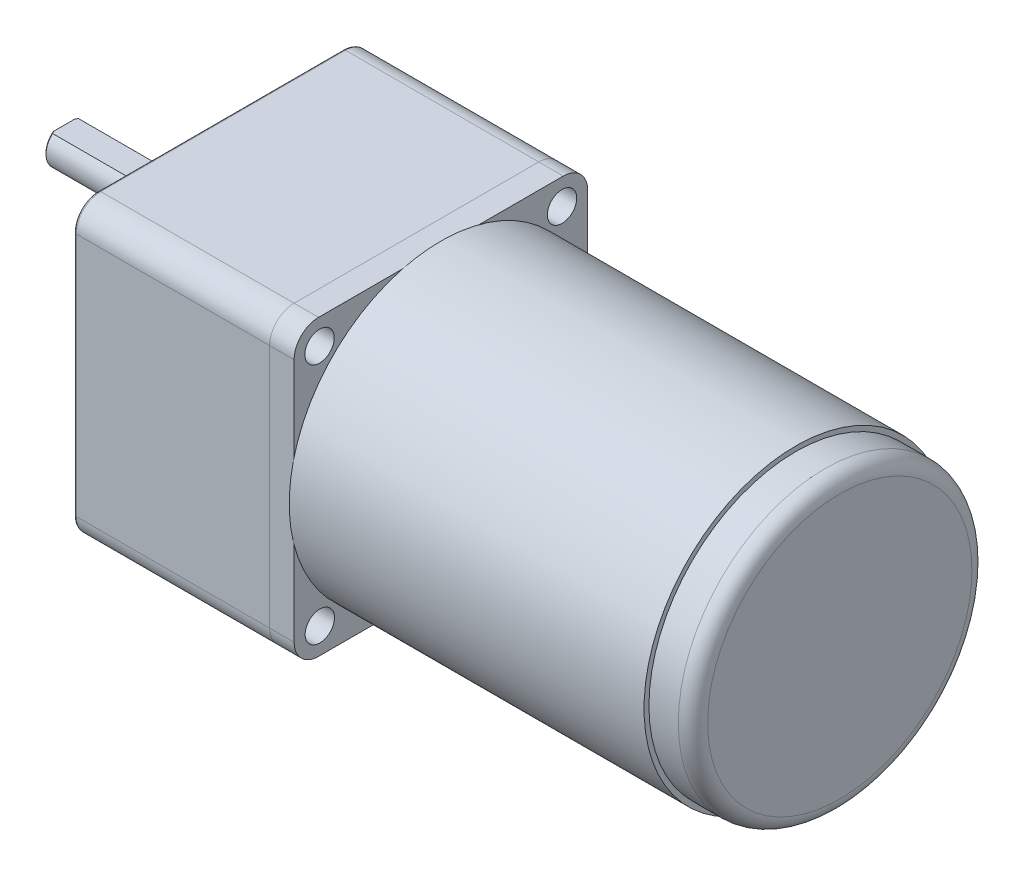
ISO-10303-21;
HEADER;
FILE_DESCRIPTION(('STEP AP214'),'2;1');
FILE_NAME('part.step','',(''),(''),'','','');
FILE_SCHEMA(('AUTOMOTIVE_DESIGN { 1 0 10303 214 1 1 1 1 }'));
ENDSEC;
DATA;
#1=APPLICATION_CONTEXT('core data for automotive mechanical design processes');
#2=APPLICATION_PROTOCOL_DEFINITION('international standard','automotive_design',2000,#1);
#3=PRODUCT_CONTEXT('',#1,'mechanical');
#4=PRODUCT('Part','Part','',(#3));
#5=PRODUCT_RELATED_PRODUCT_CATEGORY('part','',(#4));
#6=PRODUCT_DEFINITION_FORMATION('','',#4);
#7=PRODUCT_DEFINITION_CONTEXT('part definition',#1,'design');
#8=PRODUCT_DEFINITION('design','',#6,#7);
#9=PRODUCT_DEFINITION_SHAPE('','',#8);
#10=(LENGTH_UNIT() NAMED_UNIT(*) SI_UNIT(.MILLI.,.METRE.));
#11=(NAMED_UNIT(*) PLANE_ANGLE_UNIT() SI_UNIT($,.RADIAN.));
#12=(NAMED_UNIT(*) SI_UNIT($,.STERADIAN.) SOLID_ANGLE_UNIT());
#13=UNCERTAINTY_MEASURE_WITH_UNIT(LENGTH_MEASURE(1.E-05),#10,'distance_accuracy_value','');
#14=(GEOMETRIC_REPRESENTATION_CONTEXT(3) GLOBAL_UNCERTAINTY_ASSIGNED_CONTEXT((#13)) GLOBAL_UNIT_ASSIGNED_CONTEXT((#10,
#11,#12)) REPRESENTATION_CONTEXT('',''));
#15=CARTESIAN_POINT('',(0.,0.,0.));
#16=DIRECTION('',(0.,0.,1.));
#17=DIRECTION('',(1.,0.,0.));
#18=AXIS2_PLACEMENT_3D('',#15,#16,#17);
#19=CARTESIAN_POINT('',(126.5,0.,0.));
#20=DIRECTION('',(-1.,0.,0.));
#21=DIRECTION('',(0.,0.,1.));
#22=AXIS2_PLACEMENT_3D('',#19,#20,#21);
#23=CYLINDRICAL_SURFACE('',#22,30.);
#24=CARTESIAN_POINT('',(123.5,0.,0.));
#25=DIRECTION('',(1.,0.,0.));
#26=DIRECTION('',(0.,0.,-1.));
#27=AXIS2_PLACEMENT_3D('',#24,#25,#26);
#28=CIRCLE('',#27,30.);
#29=CARTESIAN_POINT('',(123.5,0.,-30.));
#30=VERTEX_POINT('',#29);
#31=EDGE_CURVE('E11',#30,#30,#28,.F.);
#32=ORIENTED_EDGE('',*,*,#31,.T.);
#33=EDGE_LOOP('',(#32));
#34=FACE_BOUND('',#33,.T.);
#35=CARTESIAN_POINT('',(117.5,0.,0.));
#36=DIRECTION('',(1.,0.,0.));
#37=DIRECTION('',(0.,0.,-1.));
#38=AXIS2_PLACEMENT_3D('',#35,#36,#37);
#39=CIRCLE('',#38,30.);
#40=CARTESIAN_POINT('',(117.5,0.,-30.));
#41=VERTEX_POINT('',#40);
#42=EDGE_CURVE('E55',#41,#41,#39,.T.);
#43=ORIENTED_EDGE('',*,*,#42,.T.);
#44=EDGE_LOOP('',(#43));
#45=FACE_BOUND('',#44,.T.);
#46=ADVANCED_FACE('F44',(#34,#45),#23,.T.);
#47=CARTESIAN_POINT('',(126.5,0.,0.));
#48=DIRECTION('',(1.,0.,0.));
#49=DIRECTION('',(0.,0.,-1.));
#50=AXIS2_PLACEMENT_3D('',#47,#48,#49);
#51=PLANE('',#50);
#52=CARTESIAN_POINT('',(126.5,0.,0.));
#53=DIRECTION('',(1.,0.,0.));
#54=DIRECTION('',(0.,0.,-1.));
#55=AXIS2_PLACEMENT_3D('',#52,#53,#54);
#56=CIRCLE('',#55,27.);
#57=CARTESIAN_POINT('',(126.5,0.,-27.));
#58=VERTEX_POINT('',#57);
#59=EDGE_CURVE('E51',#58,#58,#56,.T.);
#60=ORIENTED_EDGE('',*,*,#59,.T.);
#61=EDGE_LOOP('',(#60));
#62=FACE_BOUND('',#61,.T.);
#63=ADVANCED_FACE('F65',(#62),#51,.T.);
#64=CARTESIAN_POINT('',(117.5,0.,0.));
#65=DIRECTION('',(1.,0.,0.));
#66=DIRECTION('',(0.,0.,-1.));
#67=AXIS2_PLACEMENT_3D('',#64,#65,#66);
#68=PLANE('',#67);
#69=ORIENTED_EDGE('',*,*,#42,.F.);
#70=EDGE_LOOP('',(#69));
#71=FACE_BOUND('',#70,.T.);
#72=ADVANCED_FACE('F63',(#71),#68,.F.);
#73=CARTESIAN_POINT('',(123.5,0.,0.));
#74=DIRECTION('',(1.,0.,0.));
#75=DIRECTION('',(0.,0.,-1.));
#76=AXIS2_PLACEMENT_3D('',#73,#74,#75);
#77=TOROIDAL_SURFACE('',#76,27.,3.);
#78=ORIENTED_EDGE('',*,*,#31,.F.);
#79=EDGE_LOOP('',(#78));
#80=FACE_BOUND('',#79,.T.);
#81=ORIENTED_EDGE('',*,*,#59,.F.);
#82=EDGE_LOOP('',(#81));
#83=FACE_BOUND('',#82,.T.);
#84=ADVANCED_FACE('F46',(#80,#83),#77,.T.);
#85=CLOSED_SHELL('',(#46,#63,#72,#84));
#86=MANIFOLD_SOLID_BREP('B2',#85);
#87=CARTESIAN_POINT('',(117.5,0.,0.));
#88=DIRECTION('',(-1.,0.,0.));
#89=DIRECTION('',(0.,0.,1.));
#90=AXIS2_PLACEMENT_3D('',#87,#88,#89);
#91=CYLINDRICAL_SURFACE('',#90,31.);
#92=CARTESIAN_POINT('',(117.5,0.,0.));
#93=DIRECTION('',(1.,0.,0.));
#94=DIRECTION('',(0.,0.,-1.));
#95=AXIS2_PLACEMENT_3D('',#92,#93,#94);
#96=CIRCLE('',#95,31.);
#97=CARTESIAN_POINT('',(117.5,0.,-31.));
#98=VERTEX_POINT('',#97);
#99=EDGE_CURVE('E43',#98,#98,#96,.T.);
#100=ORIENTED_EDGE('',*,*,#99,.F.);
#101=EDGE_LOOP('',(#100));
#102=FACE_BOUND('',#101,.T.);
#103=CARTESIAN_POINT('',(45.,0.,0.));
#104=DIRECTION('',(1.,0.,0.));
#105=DIRECTION('',(0.,0.,-1.));
#106=AXIS2_PLACEMENT_3D('',#103,#104,#105);
#107=CIRCLE('',#106,31.);
#108=CARTESIAN_POINT('',(45.,0.,-31.));
#109=VERTEX_POINT('',#108);
#110=EDGE_CURVE('E113',#109,#109,#107,.T.);
#111=ORIENTED_EDGE('',*,*,#110,.T.);
#112=EDGE_LOOP('',(#111));
#113=FACE_BOUND('',#112,.T.);
#114=ADVANCED_FACE('F110',(#102,#113),#91,.T.);
#115=CARTESIAN_POINT('',(117.5,0.,0.));
#116=DIRECTION('',(1.,0.,0.));
#117=DIRECTION('',(0.,0.,-1.));
#118=AXIS2_PLACEMENT_3D('',#115,#116,#117);
#119=PLANE('',#118);
#120=ORIENTED_EDGE('',*,*,#99,.T.);
#121=EDGE_LOOP('',(#120));
#122=FACE_BOUND('',#121,.T.);
#123=ADVANCED_FACE('F125',(#122),#119,.T.);
#124=CARTESIAN_POINT('',(45.,0.,0.));
#125=DIRECTION('',(1.,0.,0.));
#126=DIRECTION('',(0.,0.,-1.));
#127=AXIS2_PLACEMENT_3D('',#124,#125,#126);
#128=PLANE('',#127);
#129=ORIENTED_EDGE('',*,*,#110,.F.);
#130=EDGE_LOOP('',(#129));
#131=FACE_BOUND('',#130,.T.);
#132=ADVANCED_FACE('F123',(#131),#128,.F.);
#133=CLOSED_SHELL('',(#114,#123,#132));
#134=MANIFOLD_SOLID_BREP('B6',#133);
#135=CARTESIAN_POINT('',(-32.,10.,0.));
#136=DIRECTION('',(1.,0.,0.));
#137=DIRECTION('',(0.,0.,-1.));
#138=AXIS2_PLACEMENT_3D('',#135,#136,#137);
#139=CYLINDRICAL_SURFACE('',#138,4.);
#140=DIRECTION('',(-1.,0.,0.));
#141=VECTOR('',#140,1.);
#142=CARTESIAN_POINT('',(-7.,13.,2.64575131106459));
#143=LINE('',#142,#141);
#144=CARTESIAN_POINT('',(-7.,13.,2.64575131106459));
#145=VERTEX_POINT('',#144);
#146=CARTESIAN_POINT('',(-31.7,13.,2.64575131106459));
#147=VERTEX_POINT('',#146);
#148=EDGE_CURVE('E202',#145,#147,#143,.T.);
#149=ORIENTED_EDGE('',*,*,#148,.T.);
#150=CARTESIAN_POINT('',(-31.7,10.,0.));
#151=DIRECTION('',(-1.,0.,0.));
#152=DIRECTION('',(0.,0.,1.));
#153=AXIS2_PLACEMENT_3D('',#150,#151,#152);
#154=CIRCLE('',#153,4.);
#155=CARTESIAN_POINT('',(-31.7,13.,-2.64575131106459));
#156=VERTEX_POINT('',#155);
#157=EDGE_CURVE('E108',#147,#156,#154,.F.);
#158=ORIENTED_EDGE('',*,*,#157,.T.);
#159=DIRECTION('',(-1.,0.,0.));
#160=VECTOR('',#159,1.);
#161=CARTESIAN_POINT('',(-7.,13.,-2.64575131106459));
#162=LINE('',#161,#160);
#163=CARTESIAN_POINT('',(-7.,13.,-2.64575131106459));
#164=VERTEX_POINT('',#163);
#165=EDGE_CURVE('E200',#164,#156,#162,.T.);
#166=ORIENTED_EDGE('',*,*,#165,.F.);
#167=CARTESIAN_POINT('',(-7.,10.,0.));
#168=DIRECTION('',(-1.,0.,0.));
#169=DIRECTION('',(0.,0.,1.));
#170=AXIS2_PLACEMENT_3D('',#167,#168,#169);
#171=CIRCLE('',#170,4.);
#172=EDGE_CURVE('E193',#145,#164,#171,.T.);
#173=ORIENTED_EDGE('',*,*,#172,.F.);
#174=EDGE_LOOP('',(#149,#158,#166,#173));
#175=FACE_BOUND('',#174,.T.);
#176=CARTESIAN_POINT('',(-3.,10.,0.));
#177=DIRECTION('',(-1.,0.,0.));
#178=DIRECTION('',(0.,0.,1.));
#179=AXIS2_PLACEMENT_3D('',#176,#177,#178);
#180=CIRCLE('',#179,4.);
#181=CARTESIAN_POINT('',(-3.,10.,4.));
#182=VERTEX_POINT('',#181);
#183=EDGE_CURVE('E206',#182,#182,#180,.T.);
#184=ORIENTED_EDGE('',*,*,#183,.T.);
#185=EDGE_LOOP('',(#184));
#186=FACE_BOUND('',#185,.T.);
#187=ADVANCED_FACE('F159',(#175,#186),#139,.T.);
#188=CARTESIAN_POINT('',(-32.,10.,0.));
#189=DIRECTION('',(-1.,0.,0.));
#190=DIRECTION('',(0.,0.,1.));
#191=AXIS2_PLACEMENT_3D('',#188,#189,#190);
#192=PLANE('',#191);
#193=DIRECTION('',(0.,0.,1.));
#194=VECTOR('',#193,1.);
#195=CARTESIAN_POINT('',(-32.,13.,2.64575131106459));
#196=LINE('',#195,#194);
#197=CARTESIAN_POINT('',(-32.,13.,-2.16564078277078));
#198=VERTEX_POINT('',#197);
#199=CARTESIAN_POINT('',(-32.,13.,2.16564078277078));
#200=VERTEX_POINT('',#199);
#201=EDGE_CURVE('E197',#198,#200,#196,.T.);
#202=ORIENTED_EDGE('',*,*,#201,.F.);
#203=CARTESIAN_POINT('',(-32.,10.,0.));
#204=DIRECTION('',(-1.,0.,0.));
#205=DIRECTION('',(0.,0.,1.));
#206=AXIS2_PLACEMENT_3D('',#203,#204,#205);
#207=CIRCLE('',#206,3.70000000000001);
#208=EDGE_CURVE('E212',#198,#200,#207,.T.);
#209=ORIENTED_EDGE('',*,*,#208,.T.);
#210=EDGE_LOOP('',(#202,#209));
#211=FACE_BOUND('',#210,.T.);
#212=ADVANCED_FACE('F228',(#211),#192,.T.);
#213=CARTESIAN_POINT('',(-3.,10.,0.));
#214=DIRECTION('',(-1.,0.,0.));
#215=DIRECTION('',(0.,0.,1.));
#216=AXIS2_PLACEMENT_3D('',#213,#214,#215);
#217=PLANE('',#216);
#218=ORIENTED_EDGE('',*,*,#183,.F.);
#219=EDGE_LOOP('',(#218));
#220=FACE_BOUND('',#219,.T.);
#221=ADVANCED_FACE('F227',(#220),#217,.F.);
#222=CARTESIAN_POINT('',(-7.,13.,2.64575131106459));
#223=DIRECTION('',(0.,-1.,0.));
#224=DIRECTION('',(0.,0.,-1.));
#225=AXIS2_PLACEMENT_3D('',#222,#223,#224);
#226=PLANE('',#225);
#227=ORIENTED_EDGE('',*,*,#201,.T.);
#228=CARTESIAN_POINT('',(-32.,13.,2.16564078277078));
#229=CARTESIAN_POINT('',(-31.9761619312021,13.,2.20636622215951));
#230=CARTESIAN_POINT('',(-31.95199678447,13.,2.2468991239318));
#231=CARTESIAN_POINT('',(-31.9030718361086,13.,2.32759423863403));
#232=CARTESIAN_POINT('',(-31.8783121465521,13.,2.36775651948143));
#233=CARTESIAN_POINT('',(-31.8282492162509,13.,2.44773910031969));
#234=CARTESIAN_POINT('',(-31.80294598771,13.,2.48755940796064));
#235=CARTESIAN_POINT('',(-31.7518371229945,13.,2.56688695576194));
#236=CARTESIAN_POINT('',(-31.7260313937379,13.,2.60639413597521));
#237=CARTESIAN_POINT('',(-31.7000000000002,13.,2.64575131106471));
#238=B_SPLINE_CURVE_WITH_KNOTS('',3,(#228,#229,#230,#231,#232,#233,#234,#235,#236,#237),
.UNSPECIFIED.,.F.,.F.,(4,2,2,2,4),(0.,0.141564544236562,0.28310260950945,0.424637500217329,
0.566198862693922),.UNSPECIFIED.);
#239=EDGE_CURVE('E168',#200,#147,#238,.T.);
#240=ORIENTED_EDGE('',*,*,#239,.T.);
#241=ORIENTED_EDGE('',*,*,#148,.F.);
#242=DIRECTION('',(0.,0.,1.));
#243=VECTOR('',#242,1.);
#244=CARTESIAN_POINT('',(-7.,13.,2.64575131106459));
#245=LINE('',#244,#243);
#246=EDGE_CURVE('E196',#164,#145,#245,.T.);
#247=ORIENTED_EDGE('',*,*,#246,.F.);
#248=ORIENTED_EDGE('',*,*,#165,.T.);
#249=CARTESIAN_POINT('',(-31.7,13.,-2.64575131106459));
#250=CARTESIAN_POINT('',(-31.7260313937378,13.,-2.60639413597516));
#251=CARTESIAN_POINT('',(-31.7518371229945,13.,-2.56688695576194));
#252=CARTESIAN_POINT('',(-31.80294598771,13.,-2.48755940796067));
#253=CARTESIAN_POINT('',(-31.8282492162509,13.,-2.44773910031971));
#254=CARTESIAN_POINT('',(-31.878312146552,13.,-2.36775651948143));
#255=CARTESIAN_POINT('',(-31.9030718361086,13.,-2.32759423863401));
#256=CARTESIAN_POINT('',(-31.9519967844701,13.,-2.24689912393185));
#257=CARTESIAN_POINT('',(-31.9761619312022,13.,-2.20636622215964));
#258=CARTESIAN_POINT('',(-32.0000000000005,13.,-2.16564078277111));
#259=B_SPLINE_CURVE_WITH_KNOTS('',3,(#249,#250,#251,#252,#253,#254,#255,#256,#257,#258),
.UNSPECIFIED.,.F.,.F.,(4,2,2,2,4),(0.,0.141561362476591,0.283096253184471,0.424634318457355,
0.566198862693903),.UNSPECIFIED.);
#260=EDGE_CURVE('E215',#156,#198,#259,.T.);
#261=ORIENTED_EDGE('',*,*,#260,.T.);
#262=EDGE_LOOP('',(#227,#240,#241,#247,#248,#261));
#263=FACE_BOUND('',#262,.T.);
#264=ADVANCED_FACE('F199',(#263),#226,.F.);
#265=CARTESIAN_POINT('',(-7.,10.,0.));
#266=DIRECTION('',(-1.,0.,0.));
#267=DIRECTION('',(0.,0.,1.));
#268=AXIS2_PLACEMENT_3D('',#265,#266,#267);
#269=PLANE('',#268);
#270=ORIENTED_EDGE('',*,*,#172,.T.);
#271=ORIENTED_EDGE('',*,*,#246,.T.);
#272=EDGE_LOOP('',(#270,#271));
#273=FACE_BOUND('',#272,.T.);
#274=ADVANCED_FACE('F195',(#273),#269,.T.);
#275=CARTESIAN_POINT('',(-32.,10.,0.));
#276=DIRECTION('',(1.,0.,0.));
#277=DIRECTION('',(0.,0.,-1.));
#278=AXIS2_PLACEMENT_3D('',#275,#276,#277);
#279=CONICAL_SURFACE('',#278,3.70000000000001,0.785398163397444);
#280=ORIENTED_EDGE('',*,*,#260,.F.);
#281=ORIENTED_EDGE('',*,*,#157,.F.);
#282=ORIENTED_EDGE('',*,*,#239,.F.);
#283=ORIENTED_EDGE('',*,*,#208,.F.);
#284=EDGE_LOOP('',(#280,#281,#282,#283));
#285=FACE_BOUND('',#284,.T.);
#286=ADVANCED_FACE('F161',(#285),#279,.T.);
#287=CLOSED_SHELL('',(#187,#212,#221,#264,#274,#286));
#288=MANIFOLD_SOLID_BREP('B38',#287);
#289=CARTESIAN_POINT('',(-3.,10.,0.));
#290=DIRECTION('',(1.,0.,0.));
#291=DIRECTION('',(0.,0.,-1.));
#292=AXIS2_PLACEMENT_3D('',#289,#290,#291);
#293=CYLINDRICAL_SURFACE('',#292,12.);
#294=CARTESIAN_POINT('',(-2.5,10.,0.));
#295=DIRECTION('',(-1.,0.,0.));
#296=DIRECTION('',(0.,0.,1.));
#297=AXIS2_PLACEMENT_3D('',#294,#295,#296);
#298=CIRCLE('',#297,12.);
#299=CARTESIAN_POINT('',(-2.5,10.,12.));
#300=VERTEX_POINT('',#299);
#301=EDGE_CURVE('E158',#300,#300,#298,.F.);
#302=ORIENTED_EDGE('',*,*,#301,.T.);
#303=EDGE_LOOP('',(#302));
#304=FACE_BOUND('',#303,.T.);
#305=CARTESIAN_POINT('',(0.,10.,0.));
#306=DIRECTION('',(-1.,0.,0.));
#307=DIRECTION('',(0.,0.,1.));
#308=AXIS2_PLACEMENT_3D('',#305,#306,#307);
#309=CIRCLE('',#308,12.);
#310=CARTESIAN_POINT('',(0.,10.,12.));
#311=VERTEX_POINT('',#310);
#312=EDGE_CURVE('E303',#311,#311,#309,.T.);
#313=ORIENTED_EDGE('',*,*,#312,.T.);
#314=EDGE_LOOP('',(#313));
#315=FACE_BOUND('',#314,.T.);
#316=ADVANCED_FACE('F292',(#304,#315),#293,.T.);
#317=CARTESIAN_POINT('',(-3.,10.,0.));
#318=DIRECTION('',(-1.,0.,0.));
#319=DIRECTION('',(0.,0.,1.));
#320=AXIS2_PLACEMENT_3D('',#317,#318,#319);
#321=PLANE('',#320);
#322=CARTESIAN_POINT('',(-3.,10.,0.));
#323=DIRECTION('',(-1.,0.,0.));
#324=DIRECTION('',(0.,0.,1.));
#325=AXIS2_PLACEMENT_3D('',#322,#323,#324);
#326=CIRCLE('',#325,11.5);
#327=CARTESIAN_POINT('',(-3.,10.,11.5));
#328=VERTEX_POINT('',#327);
#329=EDGE_CURVE('E299',#328,#328,#326,.T.);
#330=ORIENTED_EDGE('',*,*,#329,.T.);
#331=EDGE_LOOP('',(#330));
#332=FACE_BOUND('',#331,.T.);
#333=ADVANCED_FACE('F313',(#332),#321,.T.);
#334=CARTESIAN_POINT('',(0.,10.,0.));
#335=DIRECTION('',(-1.,0.,0.));
#336=DIRECTION('',(0.,0.,1.));
#337=AXIS2_PLACEMENT_3D('',#334,#335,#336);
#338=PLANE('',#337);
#339=ORIENTED_EDGE('',*,*,#312,.F.);
#340=EDGE_LOOP('',(#339));
#341=FACE_BOUND('',#340,.T.);
#342=ADVANCED_FACE('F311',(#341),#338,.F.);
#343=CARTESIAN_POINT('',(-2.5,10.,0.));
#344=DIRECTION('',(-1.,0.,0.));
#345=DIRECTION('',(0.,0.,1.));
#346=AXIS2_PLACEMENT_3D('',#343,#344,#345);
#347=TOROIDAL_SURFACE('',#346,11.5,0.5);
#348=ORIENTED_EDGE('',*,*,#301,.F.);
#349=EDGE_LOOP('',(#348));
#350=FACE_BOUND('',#349,.T.);
#351=ORIENTED_EDGE('',*,*,#329,.F.);
#352=EDGE_LOOP('',(#351));
#353=FACE_BOUND('',#352,.T.);
#354=ADVANCED_FACE('F294',(#350,#353),#347,.T.);
#355=CLOSED_SHELL('',(#316,#333,#342,#354));
#356=MANIFOLD_SOLID_BREP('B102',#355);
#357=CARTESIAN_POINT('',(45.,25.,-25.));
#358=DIRECTION('',(-1.,0.,0.));
#359=DIRECTION('',(0.,0.,1.));
#360=AXIS2_PLACEMENT_3D('',#357,#358,#359);
#361=CYLINDRICAL_SURFACE('',#360,5.);
#362=CARTESIAN_POINT('',(40.,25.,-25.));
#363=DIRECTION('',(1.,0.,0.));
#364=DIRECTION('',(0.,0.,1.));
#365=AXIS2_PLACEMENT_3D('',#362,#363,#364);
#366=CIRCLE('',#365,5.);
#367=CARTESIAN_POINT('',(40.,25.,-30.));
#368=VERTEX_POINT('',#367);
#369=CARTESIAN_POINT('',(40.,30.,-25.));
#370=VERTEX_POINT('',#369);
#371=EDGE_CURVE('E455',#368,#370,#366,.T.);
#372=ORIENTED_EDGE('',*,*,#371,.T.);
#373=DIRECTION('',(-1.,0.,0.));
#374=VECTOR('',#373,1.);
#375=CARTESIAN_POINT('',(45.,30.,-25.));
#376=LINE('',#375,#374);
#377=CARTESIAN_POINT('',(45.,30.,-25.));
#378=VERTEX_POINT('',#377);
#379=EDGE_CURVE('E290',#378,#370,#376,.T.);
#380=ORIENTED_EDGE('',*,*,#379,.F.);
#381=CARTESIAN_POINT('',(45.,25.,-25.));
#382=DIRECTION('',(1.,0.,0.));
#383=DIRECTION('',(0.,0.,1.));
#384=AXIS2_PLACEMENT_3D('',#381,#382,#383);
#385=CIRCLE('',#384,5.);
#386=CARTESIAN_POINT('',(45.,25.,-30.));
#387=VERTEX_POINT('',#386);
#388=EDGE_CURVE('E469',#387,#378,#385,.T.);
#389=ORIENTED_EDGE('',*,*,#388,.F.);
#390=DIRECTION('',(-1.,0.,0.));
#391=VECTOR('',#390,1.);
#392=CARTESIAN_POINT('',(45.,25.,-30.));
#393=LINE('',#392,#391);
#394=EDGE_CURVE('E451',#387,#368,#393,.T.);
#395=ORIENTED_EDGE('',*,*,#394,.T.);
#396=EDGE_LOOP('',(#372,#380,#389,#395));
#397=FACE_BOUND('',#396,.T.);
#398=ADVANCED_FACE('F357',(#397),#361,.T.);
#399=CARTESIAN_POINT('',(45.,30.,25.));
#400=DIRECTION('',(0.,-1.,0.));
#401=DIRECTION('',(0.,0.,-1.));
#402=AXIS2_PLACEMENT_3D('',#399,#400,#401);
#403=PLANE('',#402);
#404=DIRECTION('',(0.,0.,1.));
#405=VECTOR('',#404,1.);
#406=CARTESIAN_POINT('',(40.,30.,25.));
#407=LINE('',#406,#405);
#408=CARTESIAN_POINT('',(40.,30.,25.));
#409=VERTEX_POINT('',#408);
#410=EDGE_CURVE('E458',#370,#409,#407,.T.);
#411=ORIENTED_EDGE('',*,*,#410,.T.);
#412=DIRECTION('',(-1.,0.,0.));
#413=VECTOR('',#412,1.);
#414=CARTESIAN_POINT('',(45.,30.,25.));
#415=LINE('',#414,#413);
#416=CARTESIAN_POINT('',(45.,30.,25.));
#417=VERTEX_POINT('',#416);
#418=EDGE_CURVE('E366',#417,#409,#415,.T.);
#419=ORIENTED_EDGE('',*,*,#418,.F.);
#420=DIRECTION('',(0.,0.,1.));
#421=VECTOR('',#420,1.);
#422=CARTESIAN_POINT('',(45.,30.,25.));
#423=LINE('',#422,#421);
#424=EDGE_CURVE('E418',#378,#417,#423,.T.);
#425=ORIENTED_EDGE('',*,*,#424,.F.);
#426=ORIENTED_EDGE('',*,*,#379,.T.);
#427=EDGE_LOOP('',(#411,#419,#425,#426));
#428=FACE_BOUND('',#427,.T.);
#429=ADVANCED_FACE('F523',(#428),#403,.F.);
#430=CARTESIAN_POINT('',(45.,25.,25.));
#431=DIRECTION('',(-1.,0.,0.));
#432=DIRECTION('',(0.,0.,1.));
#433=AXIS2_PLACEMENT_3D('',#430,#431,#432);
#434=CYLINDRICAL_SURFACE('',#433,5.);
#435=CARTESIAN_POINT('',(40.,25.,25.));
#436=DIRECTION('',(1.,0.,0.));
#437=DIRECTION('',(0.,0.,1.));
#438=AXIS2_PLACEMENT_3D('',#435,#436,#437);
#439=CIRCLE('',#438,5.);
#440=CARTESIAN_POINT('',(40.,25.,30.));
#441=VERTEX_POINT('',#440);
#442=EDGE_CURVE('E460',#409,#441,#439,.T.);
#443=ORIENTED_EDGE('',*,*,#442,.T.);
#444=DIRECTION('',(-1.,0.,0.));
#445=VECTOR('',#444,1.);
#446=CARTESIAN_POINT('',(45.,25.,30.));
#447=LINE('',#446,#445);
#448=CARTESIAN_POINT('',(45.,25.,30.));
#449=VERTEX_POINT('',#448);
#450=EDGE_CURVE('E476',#449,#441,#447,.T.);
#451=ORIENTED_EDGE('',*,*,#450,.F.);
#452=CARTESIAN_POINT('',(45.,25.,25.));
#453=DIRECTION('',(1.,0.,0.));
#454=DIRECTION('',(0.,0.,1.));
#455=AXIS2_PLACEMENT_3D('',#452,#453,#454);
#456=CIRCLE('',#455,5.);
#457=EDGE_CURVE('E624',#417,#449,#456,.T.);
#458=ORIENTED_EDGE('',*,*,#457,.F.);
#459=ORIENTED_EDGE('',*,*,#418,.T.);
#460=EDGE_LOOP('',(#443,#451,#458,#459));
#461=FACE_BOUND('',#460,.T.);
#462=ADVANCED_FACE('F527',(#461),#434,.T.);
#463=CARTESIAN_POINT('',(45.,-25.,30.));
#464=DIRECTION('',(0.,0.,-1.));
#465=DIRECTION('',(-1.,0.,0.));
#466=AXIS2_PLACEMENT_3D('',#463,#464,#465);
#467=PLANE('',#466);
#468=DIRECTION('',(0.,-1.,0.));
#469=VECTOR('',#468,1.);
#470=CARTESIAN_POINT('',(40.,-25.,30.));
#471=LINE('',#470,#469);
#472=CARTESIAN_POINT('',(40.,-25.,30.));
#473=VERTEX_POINT('',#472);
#474=EDGE_CURVE('E462',#441,#473,#471,.T.);
#475=ORIENTED_EDGE('',*,*,#474,.T.);
#476=DIRECTION('',(-1.,0.,0.));
#477=VECTOR('',#476,1.);
#478=CARTESIAN_POINT('',(45.,-25.,30.));
#479=LINE('',#478,#477);
#480=CARTESIAN_POINT('',(45.,-25.,30.));
#481=VERTEX_POINT('',#480);
#482=EDGE_CURVE('E473',#481,#473,#479,.T.);
#483=ORIENTED_EDGE('',*,*,#482,.F.);
#484=DIRECTION('',(0.,-1.,0.));
#485=VECTOR('',#484,1.);
#486=CARTESIAN_POINT('',(45.,-25.,30.));
#487=LINE('',#486,#485);
#488=EDGE_CURVE('E626',#449,#481,#487,.T.);
#489=ORIENTED_EDGE('',*,*,#488,.F.);
#490=ORIENTED_EDGE('',*,*,#450,.T.);
#491=EDGE_LOOP('',(#475,#483,#489,#490));
#492=FACE_BOUND('',#491,.T.);
#493=ADVANCED_FACE('F531',(#492),#467,.F.);
#494=CARTESIAN_POINT('',(45.,-25.,25.));
#495=DIRECTION('',(-1.,0.,0.));
#496=DIRECTION('',(0.,0.,1.));
#497=AXIS2_PLACEMENT_3D('',#494,#495,#496);
#498=CYLINDRICAL_SURFACE('',#497,5.);
#499=CARTESIAN_POINT('',(40.,-25.,25.));
#500=DIRECTION('',(1.,0.,0.));
#501=DIRECTION('',(0.,0.,1.));
#502=AXIS2_PLACEMENT_3D('',#499,#500,#501);
#503=CIRCLE('',#502,5.);
#504=CARTESIAN_POINT('',(40.,-30.,25.));
#505=VERTEX_POINT('',#504);
#506=EDGE_CURVE('E464',#473,#505,#503,.T.);
#507=ORIENTED_EDGE('',*,*,#506,.T.);
#508=DIRECTION('',(-1.,0.,0.));
#509=VECTOR('',#508,1.);
#510=CARTESIAN_POINT('',(45.,-30.,25.));
#511=LINE('',#510,#509);
#512=CARTESIAN_POINT('',(45.,-30.,25.));
#513=VERTEX_POINT('',#512);
#514=EDGE_CURVE('E446',#513,#505,#511,.T.);
#515=ORIENTED_EDGE('',*,*,#514,.F.);
#516=CARTESIAN_POINT('',(45.,-25.,25.));
#517=DIRECTION('',(1.,0.,0.));
#518=DIRECTION('',(0.,0.,1.));
#519=AXIS2_PLACEMENT_3D('',#516,#517,#518);
#520=CIRCLE('',#519,5.);
#521=EDGE_CURVE('E437',#481,#513,#520,.T.);
#522=ORIENTED_EDGE('',*,*,#521,.F.);
#523=ORIENTED_EDGE('',*,*,#482,.T.);
#524=EDGE_LOOP('',(#507,#515,#522,#523));
#525=FACE_BOUND('',#524,.T.);
#526=ADVANCED_FACE('F537',(#525),#498,.T.);
#527=CARTESIAN_POINT('',(45.,-30.,25.));
#528=DIRECTION('',(0.,1.,0.));
#529=DIRECTION('',(0.,0.,1.));
#530=AXIS2_PLACEMENT_3D('',#527,#528,#529);
#531=PLANE('',#530);
#532=DIRECTION('',(0.,0.,-1.));
#533=VECTOR('',#532,1.);
#534=CARTESIAN_POINT('',(40.,-30.,25.));
#535=LINE('',#534,#533);
#536=CARTESIAN_POINT('',(40.,-30.,-25.));
#537=VERTEX_POINT('',#536);
#538=EDGE_CURVE('E445',#505,#537,#535,.T.);
#539=ORIENTED_EDGE('',*,*,#538,.T.);
#540=DIRECTION('',(-1.,0.,0.));
#541=VECTOR('',#540,1.);
#542=CARTESIAN_POINT('',(45.,-30.,-25.));
#543=LINE('',#542,#541);
#544=CARTESIAN_POINT('',(45.,-30.,-25.));
#545=VERTEX_POINT('',#544);
#546=EDGE_CURVE('E442',#545,#537,#543,.T.);
#547=ORIENTED_EDGE('',*,*,#546,.F.);
#548=DIRECTION('',(0.,0.,-1.));
#549=VECTOR('',#548,1.);
#550=CARTESIAN_POINT('',(45.,-30.,25.));
#551=LINE('',#550,#549);
#552=EDGE_CURVE('E431',#513,#545,#551,.T.);
#553=ORIENTED_EDGE('',*,*,#552,.F.);
#554=ORIENTED_EDGE('',*,*,#514,.T.);
#555=EDGE_LOOP('',(#539,#547,#553,#554));
#556=FACE_BOUND('',#555,.T.);
#557=ADVANCED_FACE('F443',(#556),#531,.F.);
#558=CARTESIAN_POINT('',(45.,-25.,-25.));
#559=DIRECTION('',(-1.,0.,0.));
#560=DIRECTION('',(0.,0.,1.));
#561=AXIS2_PLACEMENT_3D('',#558,#559,#560);
#562=CYLINDRICAL_SURFACE('',#561,5.);
#563=CARTESIAN_POINT('',(40.,-25.,-25.));
#564=DIRECTION('',(1.,0.,0.));
#565=DIRECTION('',(0.,0.,-1.));
#566=AXIS2_PLACEMENT_3D('',#563,#564,#565);
#567=CIRCLE('',#566,5.);
#568=CARTESIAN_POINT('',(40.,-25.,-30.));
#569=VERTEX_POINT('',#568);
#570=EDGE_CURVE('E404',#537,#569,#567,.T.);
#571=ORIENTED_EDGE('',*,*,#570,.T.);
#572=DIRECTION('',(-1.,0.,0.));
#573=VECTOR('',#572,1.);
#574=CARTESIAN_POINT('',(45.,-25.,-30.));
#575=LINE('',#574,#573);
#576=CARTESIAN_POINT('',(45.,-25.,-30.));
#577=VERTEX_POINT('',#576);
#578=EDGE_CURVE('E447',#577,#569,#575,.T.);
#579=ORIENTED_EDGE('',*,*,#578,.F.);
#580=CARTESIAN_POINT('',(45.,-25.,-25.));
#581=DIRECTION('',(1.,0.,0.));
#582=DIRECTION('',(0.,0.,-1.));
#583=AXIS2_PLACEMENT_3D('',#580,#581,#582);
#584=CIRCLE('',#583,5.);
#585=EDGE_CURVE('E435',#545,#577,#584,.T.);
#586=ORIENTED_EDGE('',*,*,#585,.F.);
#587=ORIENTED_EDGE('',*,*,#546,.T.);
#588=EDGE_LOOP('',(#571,#579,#586,#587));
#589=FACE_BOUND('',#588,.T.);
#590=ADVANCED_FACE('F449',(#589),#562,.T.);
#591=CARTESIAN_POINT('',(45.,-25.,-30.));
#592=DIRECTION('',(0.,0.,1.));
#593=DIRECTION('',(1.,0.,0.));
#594=AXIS2_PLACEMENT_3D('',#591,#592,#593);
#595=PLANE('',#594);
#596=DIRECTION('',(0.,1.,0.));
#597=VECTOR('',#596,1.);
#598=CARTESIAN_POINT('',(40.,-25.,-30.));
#599=LINE('',#598,#597);
#600=EDGE_CURVE('E410',#569,#368,#599,.T.);
#601=ORIENTED_EDGE('',*,*,#600,.T.);
#602=ORIENTED_EDGE('',*,*,#394,.F.);
#603=DIRECTION('',(0.,1.,0.));
#604=VECTOR('',#603,1.);
#605=CARTESIAN_POINT('',(45.,-25.,-30.));
#606=LINE('',#605,#604);
#607=EDGE_CURVE('E375',#577,#387,#606,.T.);
#608=ORIENTED_EDGE('',*,*,#607,.F.);
#609=ORIENTED_EDGE('',*,*,#578,.T.);
#610=EDGE_LOOP('',(#601,#602,#608,#609));
#611=FACE_BOUND('',#610,.T.);
#612=ADVANCED_FACE('F512',(#611),#595,.F.);
#613=CARTESIAN_POINT('',(45.,25.,-25.));
#614=DIRECTION('',(-1.,0.,0.));
#615=DIRECTION('',(0.,0.,1.));
#616=AXIS2_PLACEMENT_3D('',#613,#614,#615);
#617=PLANE('',#616);
#618=CARTESIAN_POINT('',(45.,24.8007290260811,24.8007290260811));
#619=DIRECTION('',(1.,0.,0.));
#620=DIRECTION('',(0.,0.,-1.));
#621=AXIS2_PLACEMENT_3D('',#618,#619,#620);
#622=CIRCLE('',#621,3.);
#623=CARTESIAN_POINT('',(45.,24.8007290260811,21.8007290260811));
#624=VERTEX_POINT('',#623);
#625=EDGE_CURVE('E485',#624,#624,#622,.T.);
#626=ORIENTED_EDGE('',*,*,#625,.F.);
#627=EDGE_LOOP('',(#626));
#628=FACE_BOUND('',#627,.T.);
#629=CARTESIAN_POINT('',(45.,24.7487373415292,-24.7487373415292));
#630=DIRECTION('',(1.,0.,0.));
#631=DIRECTION('',(0.,0.,-1.));
#632=AXIS2_PLACEMENT_3D('',#629,#630,#631);
#633=CIRCLE('',#632,3.);
#634=CARTESIAN_POINT('',(45.,24.7487373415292,-27.7487373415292));
#635=VERTEX_POINT('',#634);
#636=EDGE_CURVE('E610',#635,#635,#633,.T.);
#637=ORIENTED_EDGE('',*,*,#636,.F.);
#638=EDGE_LOOP('',(#637));
#639=FACE_BOUND('',#638,.T.);
#640=CARTESIAN_POINT('',(45.,-24.7487373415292,-24.7487373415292));
#641=DIRECTION('',(1.,0.,0.));
#642=DIRECTION('',(0.,0.,-1.));
#643=AXIS2_PLACEMENT_3D('',#640,#641,#642);
#644=CIRCLE('',#643,3.);
#645=CARTESIAN_POINT('',(45.,-24.7487373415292,-27.7487373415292));
#646=VERTEX_POINT('',#645);
#647=EDGE_CURVE('E612',#646,#646,#644,.T.);
#648=ORIENTED_EDGE('',*,*,#647,.F.);
#649=EDGE_LOOP('',(#648));
#650=FACE_BOUND('',#649,.T.);
#651=CARTESIAN_POINT('',(45.,-24.7487373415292,24.7487373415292));
#652=DIRECTION('',(1.,0.,0.));
#653=DIRECTION('',(0.,0.,-1.));
#654=AXIS2_PLACEMENT_3D('',#651,#652,#653);
#655=CIRCLE('',#654,3.);
#656=CARTESIAN_POINT('',(45.,-24.7487373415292,21.7487373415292));
#657=VERTEX_POINT('',#656);
#658=EDGE_CURVE('E617',#657,#657,#655,.T.);
#659=ORIENTED_EDGE('',*,*,#658,.F.);
#660=EDGE_LOOP('',(#659));
#661=FACE_BOUND('',#660,.T.);
#662=ORIENTED_EDGE('',*,*,#388,.T.);
#663=ORIENTED_EDGE('',*,*,#424,.T.);
#664=ORIENTED_EDGE('',*,*,#457,.T.);
#665=ORIENTED_EDGE('',*,*,#488,.T.);
#666=ORIENTED_EDGE('',*,*,#521,.T.);
#667=ORIENTED_EDGE('',*,*,#552,.T.);
#668=ORIENTED_EDGE('',*,*,#585,.T.);
#669=ORIENTED_EDGE('',*,*,#607,.T.);
#670=EDGE_LOOP('',(#662,#663,#664,#665,#666,#667,#668,#669));
#671=FACE_BOUND('',#670,.T.);
#672=ADVANCED_FACE('F433',(#628,#639,#650,#661,#671),#617,.F.);
#673=CARTESIAN_POINT('',(40.,25.,-25.));
#674=DIRECTION('',(-1.,0.,0.));
#675=DIRECTION('',(0.,0.,1.));
#676=AXIS2_PLACEMENT_3D('',#673,#674,#675);
#677=PLANE('',#676);
#678=CARTESIAN_POINT('',(40.,24.8007290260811,24.8007290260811));
#679=DIRECTION('',(-1.,0.,0.));
#680=DIRECTION('',(0.,0.,1.));
#681=AXIS2_PLACEMENT_3D('',#678,#679,#680);
#682=CIRCLE('',#681,3.);
#683=CARTESIAN_POINT('',(40.,24.8007290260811,27.8007290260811));
#684=VERTEX_POINT('',#683);
#685=EDGE_CURVE('E360',#684,#684,#682,.T.);
#686=ORIENTED_EDGE('',*,*,#685,.F.);
#687=EDGE_LOOP('',(#686));
#688=FACE_BOUND('',#687,.T.);
#689=CARTESIAN_POINT('',(40.,24.7487373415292,-24.7487373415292));
#690=DIRECTION('',(-1.,0.,0.));
#691=DIRECTION('',(0.,0.,1.));
#692=AXIS2_PLACEMENT_3D('',#689,#690,#691);
#693=CIRCLE('',#692,3.);
#694=CARTESIAN_POINT('',(40.,24.7487373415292,-21.7487373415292));
#695=VERTEX_POINT('',#694);
#696=EDGE_CURVE('E487',#695,#695,#693,.T.);
#697=ORIENTED_EDGE('',*,*,#696,.F.);
#698=EDGE_LOOP('',(#697));
#699=FACE_BOUND('',#698,.T.);
#700=CARTESIAN_POINT('',(40.,-24.7487373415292,-24.7487373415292));
#701=DIRECTION('',(-1.,0.,0.));
#702=DIRECTION('',(0.,0.,1.));
#703=AXIS2_PLACEMENT_3D('',#700,#701,#702);
#704=CIRCLE('',#703,3.);
#705=CARTESIAN_POINT('',(40.,-24.7487373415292,-21.7487373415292));
#706=VERTEX_POINT('',#705);
#707=EDGE_CURVE('E484',#706,#706,#704,.T.);
#708=ORIENTED_EDGE('',*,*,#707,.F.);
#709=EDGE_LOOP('',(#708));
#710=FACE_BOUND('',#709,.T.);
#711=CARTESIAN_POINT('',(40.,-24.7487373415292,24.7487373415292));
#712=DIRECTION('',(-1.,0.,0.));
#713=DIRECTION('',(0.,0.,1.));
#714=AXIS2_PLACEMENT_3D('',#711,#712,#713);
#715=CIRCLE('',#714,3.);
#716=CARTESIAN_POINT('',(40.,-24.7487373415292,27.7487373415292));
#717=VERTEX_POINT('',#716);
#718=EDGE_CURVE('E481',#717,#717,#715,.T.);
#719=ORIENTED_EDGE('',*,*,#718,.F.);
#720=EDGE_LOOP('',(#719));
#721=FACE_BOUND('',#720,.T.);
#722=ORIENTED_EDGE('',*,*,#371,.F.);
#723=ORIENTED_EDGE('',*,*,#600,.F.);
#724=ORIENTED_EDGE('',*,*,#570,.F.);
#725=ORIENTED_EDGE('',*,*,#538,.F.);
#726=ORIENTED_EDGE('',*,*,#506,.F.);
#727=ORIENTED_EDGE('',*,*,#474,.F.);
#728=ORIENTED_EDGE('',*,*,#442,.F.);
#729=ORIENTED_EDGE('',*,*,#410,.F.);
#730=EDGE_LOOP('',(#722,#723,#724,#725,#726,#727,#728,#729));
#731=FACE_BOUND('',#730,.T.);
#732=ADVANCED_FACE('F497',(#688,#699,#710,#721,#731),#677,.T.);
#733=CARTESIAN_POINT('',(12.,-24.7487373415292,24.7487373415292));
#734=DIRECTION('',(1.,0.,0.));
#735=DIRECTION('',(0.,0.,-1.));
#736=AXIS2_PLACEMENT_3D('',#733,#734,#735);
#737=CYLINDRICAL_SURFACE('',#736,3.);
#738=ORIENTED_EDGE('',*,*,#718,.T.);
#739=EDGE_LOOP('',(#738));
#740=FACE_BOUND('',#739,.T.);
#741=ORIENTED_EDGE('',*,*,#658,.T.);
#742=EDGE_LOOP('',(#741));
#743=FACE_BOUND('',#742,.T.);
#744=ADVANCED_FACE('F500',(#740,#743),#737,.F.);
#745=CARTESIAN_POINT('',(12.,-24.7487373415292,-24.7487373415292));
#746=DIRECTION('',(1.,0.,0.));
#747=DIRECTION('',(0.,0.,-1.));
#748=AXIS2_PLACEMENT_3D('',#745,#746,#747);
#749=CYLINDRICAL_SURFACE('',#748,3.);
#750=ORIENTED_EDGE('',*,*,#707,.T.);
#751=EDGE_LOOP('',(#750));
#752=FACE_BOUND('',#751,.T.);
#753=ORIENTED_EDGE('',*,*,#647,.T.);
#754=EDGE_LOOP('',(#753));
#755=FACE_BOUND('',#754,.T.);
#756=ADVANCED_FACE('F576',(#752,#755),#749,.F.);
#757=CARTESIAN_POINT('',(12.,24.7487373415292,-24.7487373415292));
#758=DIRECTION('',(1.,0.,0.));
#759=DIRECTION('',(0.,0.,-1.));
#760=AXIS2_PLACEMENT_3D('',#757,#758,#759);
#761=CYLINDRICAL_SURFACE('',#760,3.);
#762=ORIENTED_EDGE('',*,*,#696,.T.);
#763=EDGE_LOOP('',(#762));
#764=FACE_BOUND('',#763,.T.);
#765=ORIENTED_EDGE('',*,*,#636,.T.);
#766=EDGE_LOOP('',(#765));
#767=FACE_BOUND('',#766,.T.);
#768=ADVANCED_FACE('F586',(#764,#767),#761,.F.);
#769=CARTESIAN_POINT('',(12.,24.8007290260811,24.8007290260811));
#770=DIRECTION('',(1.,0.,0.));
#771=DIRECTION('',(0.,0.,-1.));
#772=AXIS2_PLACEMENT_3D('',#769,#770,#771);
#773=CYLINDRICAL_SURFACE('',#772,3.);
#774=ORIENTED_EDGE('',*,*,#685,.T.);
#775=EDGE_LOOP('',(#774));
#776=FACE_BOUND('',#775,.T.);
#777=ORIENTED_EDGE('',*,*,#625,.T.);
#778=EDGE_LOOP('',(#777));
#779=FACE_BOUND('',#778,.T.);
#780=ADVANCED_FACE('F494',(#776,#779),#773,.F.);
#781=CLOSED_SHELL('',(#398,#429,#462,#493,#526,#557,#590,#612,#672,#732,#744,#756,#768,#780));
#782=MANIFOLD_SOLID_BREP('B153',#781);
#783=CARTESIAN_POINT('',(40.,-25.,25.));
#784=DIRECTION('',(-1.,0.,0.));
#785=DIRECTION('',(0.,0.,1.));
#786=AXIS2_PLACEMENT_3D('',#783,#784,#785);
#787=CYLINDRICAL_SURFACE('',#786,5.);
#788=DIRECTION('',(-1.,0.,0.));
#789=VECTOR('',#788,1.);
#790=CARTESIAN_POINT('',(40.,-25.,30.));
#791=LINE('',#790,#789);
#792=CARTESIAN_POINT('',(40.,-25.,30.));
#793=VERTEX_POINT('',#792);
#794=CARTESIAN_POINT('',(0.5,-25.,30.));
#795=VERTEX_POINT('',#794);
#796=EDGE_CURVE('E884',#793,#795,#791,.T.);
#797=ORIENTED_EDGE('',*,*,#796,.T.);
#798=CARTESIAN_POINT('',(0.5,-25.,25.));
#799=DIRECTION('',(-1.,0.,0.));
#800=DIRECTION('',(0.,0.,1.));
#801=AXIS2_PLACEMENT_3D('',#798,#799,#800);
#802=CIRCLE('',#801,5.);
#803=CARTESIAN_POINT('',(0.5,-30.,25.));
#804=VERTEX_POINT('',#803);
#805=EDGE_CURVE('E355',#795,#804,#802,.F.);
#806=ORIENTED_EDGE('',*,*,#805,.T.);
#807=DIRECTION('',(-1.,0.,0.));
#808=VECTOR('',#807,1.);
#809=CARTESIAN_POINT('',(40.,-30.,25.));
#810=LINE('',#809,#808);
#811=CARTESIAN_POINT('',(40.,-30.,25.));
#812=VERTEX_POINT('',#811);
#813=EDGE_CURVE('E766',#812,#804,#810,.T.);
#814=ORIENTED_EDGE('',*,*,#813,.F.);
#815=CARTESIAN_POINT('',(40.,-25.,25.));
#816=DIRECTION('',(1.,0.,0.));
#817=DIRECTION('',(0.,0.,1.));
#818=AXIS2_PLACEMENT_3D('',#815,#816,#817);
#819=CIRCLE('',#818,5.);
#820=EDGE_CURVE('E773',#793,#812,#819,.T.);
#821=ORIENTED_EDGE('',*,*,#820,.F.);
#822=EDGE_LOOP('',(#797,#806,#814,#821));
#823=FACE_BOUND('',#822,.T.);
#824=ADVANCED_FACE('F669',(#823),#787,.T.);
#825=CARTESIAN_POINT('',(40.,-30.,25.));
#826=DIRECTION('',(0.,1.,0.));
#827=DIRECTION('',(0.,0.,1.));
#828=AXIS2_PLACEMENT_3D('',#825,#826,#827);
#829=PLANE('',#828);
#830=ORIENTED_EDGE('',*,*,#813,.T.);
#831=DIRECTION('',(0.,0.,-1.));
#832=VECTOR('',#831,1.);
#833=CARTESIAN_POINT('',(0.5,-30.,-25.));
#834=LINE('',#833,#832);
#835=CARTESIAN_POINT('',(0.5,-30.,-25.));
#836=VERTEX_POINT('',#835);
#837=EDGE_CURVE('E786',#804,#836,#834,.T.);
#838=ORIENTED_EDGE('',*,*,#837,.T.);
#839=DIRECTION('',(-1.,0.,0.));
#840=VECTOR('',#839,1.);
#841=CARTESIAN_POINT('',(40.,-30.,-25.));
#842=LINE('',#841,#840);
#843=CARTESIAN_POINT('',(40.,-30.,-25.));
#844=VERTEX_POINT('',#843);
#845=EDGE_CURVE('E769',#844,#836,#842,.T.);
#846=ORIENTED_EDGE('',*,*,#845,.F.);
#847=DIRECTION('',(0.,0.,-1.));
#848=VECTOR('',#847,1.);
#849=CARTESIAN_POINT('',(40.,-30.,25.));
#850=LINE('',#849,#848);
#851=EDGE_CURVE('E761',#812,#844,#850,.T.);
#852=ORIENTED_EDGE('',*,*,#851,.F.);
#853=EDGE_LOOP('',(#830,#838,#846,#852));
#854=FACE_BOUND('',#853,.T.);
#855=ADVANCED_FACE('F763',(#854),#829,.F.);
#856=CARTESIAN_POINT('',(40.,-25.,-25.));
#857=DIRECTION('',(-1.,0.,0.));
#858=DIRECTION('',(0.,0.,1.));
#859=AXIS2_PLACEMENT_3D('',#856,#857,#858);
#860=CYLINDRICAL_SURFACE('',#859,5.);
#861=ORIENTED_EDGE('',*,*,#845,.T.);
#862=CARTESIAN_POINT('',(0.5,-25.,-25.));
#863=DIRECTION('',(-1.,0.,0.));
#864=DIRECTION('',(0.,0.,1.));
#865=AXIS2_PLACEMENT_3D('',#862,#863,#864);
#866=CIRCLE('',#865,5.);
#867=CARTESIAN_POINT('',(0.5,-25.,-30.));
#868=VERTEX_POINT('',#867);
#869=EDGE_CURVE('E810',#836,#868,#866,.F.);
#870=ORIENTED_EDGE('',*,*,#869,.T.);
#871=DIRECTION('',(-1.,0.,0.));
#872=VECTOR('',#871,1.);
#873=CARTESIAN_POINT('',(40.,-25.,-30.));
#874=LINE('',#873,#872);
#875=CARTESIAN_POINT('',(40.,-25.,-30.));
#876=VERTEX_POINT('',#875);
#877=EDGE_CURVE('E788',#876,#868,#874,.T.);
#878=ORIENTED_EDGE('',*,*,#877,.F.);
#879=CARTESIAN_POINT('',(40.,-25.,-25.));
#880=DIRECTION('',(1.,0.,0.));
#881=DIRECTION('',(0.,0.,-1.));
#882=AXIS2_PLACEMENT_3D('',#879,#880,#881);
#883=CIRCLE('',#882,5.);
#884=EDGE_CURVE('E772',#844,#876,#883,.T.);
#885=ORIENTED_EDGE('',*,*,#884,.F.);
#886=EDGE_LOOP('',(#861,#870,#878,#885));
#887=FACE_BOUND('',#886,.T.);
#888=ADVANCED_FACE('F949',(#887),#860,.T.);
#889=CARTESIAN_POINT('',(40.,-25.,-30.));
#890=DIRECTION('',(0.,0.,1.));
#891=DIRECTION('',(1.,0.,0.));
#892=AXIS2_PLACEMENT_3D('',#889,#890,#891);
#893=PLANE('',#892);
#894=ORIENTED_EDGE('',*,*,#877,.T.);
#895=DIRECTION('',(0.,1.,0.));
#896=VECTOR('',#895,1.);
#897=CARTESIAN_POINT('',(0.5,25.,-30.));
#898=LINE('',#897,#896);
#899=CARTESIAN_POINT('',(0.5,25.,-30.));
#900=VERTEX_POINT('',#899);
#901=EDGE_CURVE('E812',#868,#900,#898,.T.);
#902=ORIENTED_EDGE('',*,*,#901,.T.);
#903=DIRECTION('',(-1.,0.,0.));
#904=VECTOR('',#903,1.);
#905=CARTESIAN_POINT('',(40.,25.,-30.));
#906=LINE('',#905,#904);
#907=CARTESIAN_POINT('',(40.,25.,-30.));
#908=VERTEX_POINT('',#907);
#909=EDGE_CURVE('E893',#908,#900,#906,.T.);
#910=ORIENTED_EDGE('',*,*,#909,.F.);
#911=DIRECTION('',(0.,1.,0.));
#912=VECTOR('',#911,1.);
#913=CARTESIAN_POINT('',(40.,-25.,-30.));
#914=LINE('',#913,#912);
#915=EDGE_CURVE('E875',#876,#908,#914,.T.);
#916=ORIENTED_EDGE('',*,*,#915,.F.);
#917=EDGE_LOOP('',(#894,#902,#910,#916));
#918=FACE_BOUND('',#917,.T.);
#919=ADVANCED_FACE('F900',(#918),#893,.F.);
#920=CARTESIAN_POINT('',(40.,25.,-25.));
#921=DIRECTION('',(-1.,0.,0.));
#922=DIRECTION('',(0.,0.,1.));
#923=AXIS2_PLACEMENT_3D('',#920,#921,#922);
#924=CYLINDRICAL_SURFACE('',#923,5.);
#925=ORIENTED_EDGE('',*,*,#909,.T.);
#926=CARTESIAN_POINT('',(0.5,25.,-25.));
#927=DIRECTION('',(-1.,0.,0.));
#928=DIRECTION('',(0.,0.,1.));
#929=AXIS2_PLACEMENT_3D('',#926,#927,#928);
#930=CIRCLE('',#929,5.);
#931=CARTESIAN_POINT('',(0.5,30.,-25.));
#932=VERTEX_POINT('',#931);
#933=EDGE_CURVE('E814',#900,#932,#930,.F.);
#934=ORIENTED_EDGE('',*,*,#933,.T.);
#935=DIRECTION('',(-1.,0.,0.));
#936=VECTOR('',#935,1.);
#937=CARTESIAN_POINT('',(40.,30.,-25.));
#938=LINE('',#937,#936);
#939=CARTESIAN_POINT('',(40.,30.,-25.));
#940=VERTEX_POINT('',#939);
#941=EDGE_CURVE('E890',#940,#932,#938,.T.);
#942=ORIENTED_EDGE('',*,*,#941,.F.);
#943=CARTESIAN_POINT('',(40.,25.,-25.));
#944=DIRECTION('',(1.,0.,0.));
#945=DIRECTION('',(0.,0.,1.));
#946=AXIS2_PLACEMENT_3D('',#943,#944,#945);
#947=CIRCLE('',#946,5.);
#948=EDGE_CURVE('E877',#908,#940,#947,.T.);
#949=ORIENTED_EDGE('',*,*,#948,.F.);
#950=EDGE_LOOP('',(#925,#934,#942,#949));
#951=FACE_BOUND('',#950,.T.);
#952=ADVANCED_FACE('F942',(#951),#924,.T.);
#953=CARTESIAN_POINT('',(40.,30.,25.));
#954=DIRECTION('',(0.,-1.,0.));
#955=DIRECTION('',(0.,0.,-1.));
#956=AXIS2_PLACEMENT_3D('',#953,#954,#955);
#957=PLANE('',#956);
#958=ORIENTED_EDGE('',*,*,#941,.T.);
#959=DIRECTION('',(0.,0.,1.));
#960=VECTOR('',#959,1.);
#961=CARTESIAN_POINT('',(0.5,30.,25.));
#962=LINE('',#961,#960);
#963=CARTESIAN_POINT('',(0.5,30.,25.));
#964=VERTEX_POINT('',#963);
#965=EDGE_CURVE('E816',#932,#964,#962,.T.);
#966=ORIENTED_EDGE('',*,*,#965,.T.);
#967=DIRECTION('',(-1.,0.,0.));
#968=VECTOR('',#967,1.);
#969=CARTESIAN_POINT('',(40.,30.,25.));
#970=LINE('',#969,#968);
#971=CARTESIAN_POINT('',(40.,30.,25.));
#972=VERTEX_POINT('',#971);
#973=EDGE_CURVE('E888',#972,#964,#970,.T.);
#974=ORIENTED_EDGE('',*,*,#973,.F.);
#975=DIRECTION('',(0.,0.,1.));
#976=VECTOR('',#975,1.);
#977=CARTESIAN_POINT('',(40.,30.,25.));
#978=LINE('',#977,#976);
#979=EDGE_CURVE('E879',#940,#972,#978,.T.);
#980=ORIENTED_EDGE('',*,*,#979,.F.);
#981=EDGE_LOOP('',(#958,#966,#974,#980));
#982=FACE_BOUND('',#981,.T.);
#983=ADVANCED_FACE('F946',(#982),#957,.F.);
#984=CARTESIAN_POINT('',(40.,25.,25.));
#985=DIRECTION('',(-1.,0.,0.));
#986=DIRECTION('',(0.,0.,1.));
#987=AXIS2_PLACEMENT_3D('',#984,#985,#986);
#988=CYLINDRICAL_SURFACE('',#987,5.);
#989=ORIENTED_EDGE('',*,*,#973,.T.);
#990=CARTESIAN_POINT('',(0.5,25.,25.));
#991=DIRECTION('',(-1.,0.,0.));
#992=DIRECTION('',(0.,0.,1.));
#993=AXIS2_PLACEMENT_3D('',#990,#991,#992);
#994=CIRCLE('',#993,5.);
#995=CARTESIAN_POINT('',(0.5,25.,30.));
#996=VERTEX_POINT('',#995);
#997=EDGE_CURVE('E693',#964,#996,#994,.F.);
#998=ORIENTED_EDGE('',*,*,#997,.T.);
#999=DIRECTION('',(-1.,0.,0.));
#1000=VECTOR('',#999,1.);
#1001=CARTESIAN_POINT('',(40.,25.,30.));
#1002=LINE('',#1001,#1000);
#1003=CARTESIAN_POINT('',(40.,25.,30.));
#1004=VERTEX_POINT('',#1003);
#1005=EDGE_CURVE('E886',#1004,#996,#1002,.T.);
#1006=ORIENTED_EDGE('',*,*,#1005,.F.);
#1007=CARTESIAN_POINT('',(40.,25.,25.));
#1008=DIRECTION('',(1.,0.,0.));
#1009=DIRECTION('',(0.,0.,1.));
#1010=AXIS2_PLACEMENT_3D('',#1007,#1008,#1009);
#1011=CIRCLE('',#1010,5.);
#1012=EDGE_CURVE('E881',#972,#1004,#1011,.T.);
#1013=ORIENTED_EDGE('',*,*,#1012,.F.);
#1014=EDGE_LOOP('',(#989,#998,#1006,#1013));
#1015=FACE_BOUND('',#1014,.T.);
#1016=ADVANCED_FACE('F1021',(#1015),#988,.T.);
#1017=CARTESIAN_POINT('',(40.,-25.,30.));
#1018=DIRECTION('',(0.,0.,-1.));
#1019=DIRECTION('',(-1.,0.,0.));
#1020=AXIS2_PLACEMENT_3D('',#1017,#1018,#1019);
#1021=PLANE('',#1020);
#1022=ORIENTED_EDGE('',*,*,#1005,.T.);
#1023=DIRECTION('',(0.,-1.,0.));
#1024=VECTOR('',#1023,1.);
#1025=CARTESIAN_POINT('',(0.5,-25.,30.));
#1026=LINE('',#1025,#1024);
#1027=EDGE_CURVE('E678',#996,#795,#1026,.T.);
#1028=ORIENTED_EDGE('',*,*,#1027,.T.);
#1029=ORIENTED_EDGE('',*,*,#796,.F.);
#1030=DIRECTION('',(0.,-1.,0.));
#1031=VECTOR('',#1030,1.);
#1032=CARTESIAN_POINT('',(40.,-25.,30.));
#1033=LINE('',#1032,#1031);
#1034=EDGE_CURVE('E778',#1004,#793,#1033,.T.);
#1035=ORIENTED_EDGE('',*,*,#1034,.F.);
#1036=EDGE_LOOP('',(#1022,#1028,#1029,#1035));
#1037=FACE_BOUND('',#1036,.T.);
#1038=ADVANCED_FACE('F1013',(#1037),#1021,.F.);
#1039=CARTESIAN_POINT('',(40.,-25.,25.));
#1040=DIRECTION('',(-1.,0.,0.));
#1041=DIRECTION('',(0.,0.,1.));
#1042=AXIS2_PLACEMENT_3D('',#1039,#1040,#1041);
#1043=PLANE('',#1042);
#1044=CARTESIAN_POINT('',(40.,24.8007290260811,24.8007290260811));
#1045=DIRECTION('',(-1.,0.,0.));
#1046=DIRECTION('',(0.,0.,1.));
#1047=AXIS2_PLACEMENT_3D('',#1044,#1045,#1046);
#1048=CIRCLE('',#1047,3.);
#1049=CARTESIAN_POINT('',(40.,24.8007290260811,27.8007290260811));
#1050=VERTEX_POINT('',#1049);
#1051=EDGE_CURVE('E673',#1050,#1050,#1048,.T.);
#1052=ORIENTED_EDGE('',*,*,#1051,.T.);
#1053=EDGE_LOOP('',(#1052));
#1054=FACE_BOUND('',#1053,.T.);
#1055=CARTESIAN_POINT('',(40.,24.7487373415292,-24.7487373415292));
#1056=DIRECTION('',(-1.,0.,0.));
#1057=DIRECTION('',(0.,0.,1.));
#1058=AXIS2_PLACEMENT_3D('',#1055,#1056,#1057);
#1059=CIRCLE('',#1058,3.);
#1060=CARTESIAN_POINT('',(40.,24.7487373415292,-21.7487373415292));
#1061=VERTEX_POINT('',#1060);
#1062=EDGE_CURVE('E849',#1061,#1061,#1059,.T.);
#1063=ORIENTED_EDGE('',*,*,#1062,.T.);
#1064=EDGE_LOOP('',(#1063));
#1065=FACE_BOUND('',#1064,.T.);
#1066=CARTESIAN_POINT('',(40.,-24.7487373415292,-24.7487373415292));
#1067=DIRECTION('',(-1.,0.,0.));
#1068=DIRECTION('',(0.,0.,1.));
#1069=AXIS2_PLACEMENT_3D('',#1066,#1067,#1068);
#1070=CIRCLE('',#1069,3.);
#1071=CARTESIAN_POINT('',(40.,-24.7487373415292,-21.7487373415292));
#1072=VERTEX_POINT('',#1071);
#1073=EDGE_CURVE('E846',#1072,#1072,#1070,.T.);
#1074=ORIENTED_EDGE('',*,*,#1073,.T.);
#1075=EDGE_LOOP('',(#1074));
#1076=FACE_BOUND('',#1075,.T.);
#1077=CARTESIAN_POINT('',(40.,-24.7487373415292,24.7487373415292));
#1078=DIRECTION('',(-1.,0.,0.));
#1079=DIRECTION('',(0.,0.,1.));
#1080=AXIS2_PLACEMENT_3D('',#1077,#1078,#1079);
#1081=CIRCLE('',#1080,3.);
#1082=CARTESIAN_POINT('',(40.,-24.7487373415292,27.7487373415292));
#1083=VERTEX_POINT('',#1082);
#1084=EDGE_CURVE('E843',#1083,#1083,#1081,.T.);
#1085=ORIENTED_EDGE('',*,*,#1084,.T.);
#1086=EDGE_LOOP('',(#1085));
#1087=FACE_BOUND('',#1086,.T.);
#1088=ORIENTED_EDGE('',*,*,#820,.T.);
#1089=ORIENTED_EDGE('',*,*,#851,.T.);
#1090=ORIENTED_EDGE('',*,*,#884,.T.);
#1091=ORIENTED_EDGE('',*,*,#915,.T.);
#1092=ORIENTED_EDGE('',*,*,#948,.T.);
#1093=ORIENTED_EDGE('',*,*,#979,.T.);
#1094=ORIENTED_EDGE('',*,*,#1012,.T.);
#1095=ORIENTED_EDGE('',*,*,#1034,.T.);
#1096=EDGE_LOOP('',(#1088,#1089,#1090,#1091,#1092,#1093,#1094,#1095));
#1097=FACE_BOUND('',#1096,.T.);
#1098=ADVANCED_FACE('F776',(#1054,#1065,#1076,#1087,#1097),#1043,.F.);
#1099=CARTESIAN_POINT('',(0.,-25.,25.));
#1100=DIRECTION('',(-1.,0.,0.));
#1101=DIRECTION('',(0.,0.,1.));
#1102=AXIS2_PLACEMENT_3D('',#1099,#1100,#1101);
#1103=PLANE('',#1102);
#1104=CARTESIAN_POINT('',(0.,24.7487373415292,-24.7487373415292));
#1105=DIRECTION('',(-1.,0.,0.));
#1106=DIRECTION('',(0.,0.,1.));
#1107=AXIS2_PLACEMENT_3D('',#1104,#1105,#1106);
#1108=CIRCLE('',#1107,1.65);
#1109=CARTESIAN_POINT('',(0.,24.7487373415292,-23.0987373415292));
#1110=VERTEX_POINT('',#1109);
#1111=EDGE_CURVE('E854',#1110,#1110,#1108,.T.);
#1112=ORIENTED_EDGE('',*,*,#1111,.F.);
#1113=EDGE_LOOP('',(#1112));
#1114=FACE_BOUND('',#1113,.T.);
#1115=CARTESIAN_POINT('',(0.,24.7487373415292,24.7487373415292));
#1116=DIRECTION('',(-1.,0.,0.));
#1117=DIRECTION('',(0.,0.,1.));
#1118=AXIS2_PLACEMENT_3D('',#1115,#1116,#1117);
#1119=CIRCLE('',#1118,1.65);
#1120=CARTESIAN_POINT('',(0.,24.7487373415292,26.3987373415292));
#1121=VERTEX_POINT('',#1120);
#1122=EDGE_CURVE('E858',#1121,#1121,#1119,.T.);
#1123=ORIENTED_EDGE('',*,*,#1122,.F.);
#1124=EDGE_LOOP('',(#1123));
#1125=FACE_BOUND('',#1124,.T.);
#1126=CARTESIAN_POINT('',(0.,-24.7487373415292,24.7487373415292));
#1127=DIRECTION('',(-1.,0.,0.));
#1128=DIRECTION('',(0.,0.,1.));
#1129=AXIS2_PLACEMENT_3D('',#1126,#1127,#1128);
#1130=CIRCLE('',#1129,1.65);
#1131=CARTESIAN_POINT('',(0.,-24.7487373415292,26.3987373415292));
#1132=VERTEX_POINT('',#1131);
#1133=EDGE_CURVE('E863',#1132,#1132,#1130,.T.);
#1134=ORIENTED_EDGE('',*,*,#1133,.F.);
#1135=EDGE_LOOP('',(#1134));
#1136=FACE_BOUND('',#1135,.T.);
#1137=CARTESIAN_POINT('',(0.,-24.7487373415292,-24.7487373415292));
#1138=DIRECTION('',(-1.,0.,0.));
#1139=DIRECTION('',(0.,0.,1.));
#1140=AXIS2_PLACEMENT_3D('',#1137,#1138,#1139);
#1141=CIRCLE('',#1140,1.65);
#1142=CARTESIAN_POINT('',(0.,-24.7487373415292,-23.0987373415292));
#1143=VERTEX_POINT('',#1142);
#1144=EDGE_CURVE('E823',#1143,#1143,#1141,.T.);
#1145=ORIENTED_EDGE('',*,*,#1144,.F.);
#1146=EDGE_LOOP('',(#1145));
#1147=FACE_BOUND('',#1146,.T.);
#1148=CARTESIAN_POINT('',(0.,-25.,-25.));
#1149=DIRECTION('',(-1.,0.,0.));
#1150=DIRECTION('',(0.,0.,1.));
#1151=AXIS2_PLACEMENT_3D('',#1148,#1149,#1150);
#1152=CIRCLE('',#1151,4.5);
#1153=CARTESIAN_POINT('',(0.,-25.,-29.5));
#1154=VERTEX_POINT('',#1153);
#1155=CARTESIAN_POINT('',(0.,-29.5,-25.));
#1156=VERTEX_POINT('',#1155);
#1157=EDGE_CURVE('E805',#1154,#1156,#1152,.T.);
#1158=ORIENTED_EDGE('',*,*,#1157,.T.);
#1159=DIRECTION('',(0.,0.,-1.));
#1160=VECTOR('',#1159,1.);
#1161=CARTESIAN_POINT('',(0.,-29.5,25.));
#1162=LINE('',#1161,#1160);
#1163=CARTESIAN_POINT('',(0.,-29.5,25.));
#1164=VERTEX_POINT('',#1163);
#1165=EDGE_CURVE('E807',#1156,#1164,#1162,.F.);
#1166=ORIENTED_EDGE('',*,*,#1165,.T.);
#1167=CARTESIAN_POINT('',(0.,-25.,25.));
#1168=DIRECTION('',(-1.,0.,0.));
#1169=DIRECTION('',(0.,0.,1.));
#1170=AXIS2_PLACEMENT_3D('',#1167,#1168,#1169);
#1171=CIRCLE('',#1170,4.5);
#1172=CARTESIAN_POINT('',(0.,-25.,29.5));
#1173=VERTEX_POINT('',#1172);
#1174=EDGE_CURVE('E793',#1164,#1173,#1171,.T.);
#1175=ORIENTED_EDGE('',*,*,#1174,.T.);
#1176=DIRECTION('',(0.,-1.,0.));
#1177=VECTOR('',#1176,1.);
#1178=CARTESIAN_POINT('',(0.,25.,29.5));
#1179=LINE('',#1178,#1177);
#1180=CARTESIAN_POINT('',(0.,25.,29.5));
#1181=VERTEX_POINT('',#1180);
#1182=EDGE_CURVE('E795',#1173,#1181,#1179,.F.);
#1183=ORIENTED_EDGE('',*,*,#1182,.T.);
#1184=CARTESIAN_POINT('',(0.,25.,25.));
#1185=DIRECTION('',(-1.,0.,0.));
#1186=DIRECTION('',(0.,0.,1.));
#1187=AXIS2_PLACEMENT_3D('',#1184,#1185,#1186);
#1188=CIRCLE('',#1187,4.5);
#1189=CARTESIAN_POINT('',(0.,29.5,25.));
#1190=VERTEX_POINT('',#1189);
#1191=EDGE_CURVE('E797',#1181,#1190,#1188,.T.);
#1192=ORIENTED_EDGE('',*,*,#1191,.T.);
#1193=DIRECTION('',(0.,0.,1.));
#1194=VECTOR('',#1193,1.);
#1195=CARTESIAN_POINT('',(0.,29.5,-25.));
#1196=LINE('',#1195,#1194);
#1197=CARTESIAN_POINT('',(0.,29.5,-25.));
#1198=VERTEX_POINT('',#1197);
#1199=EDGE_CURVE('E799',#1190,#1198,#1196,.F.);
#1200=ORIENTED_EDGE('',*,*,#1199,.T.);
#1201=CARTESIAN_POINT('',(0.,25.,-25.));
#1202=DIRECTION('',(-1.,0.,0.));
#1203=DIRECTION('',(0.,0.,1.));
#1204=AXIS2_PLACEMENT_3D('',#1201,#1202,#1203);
#1205=CIRCLE('',#1204,4.5);
#1206=CARTESIAN_POINT('',(0.,25.,-29.5));
#1207=VERTEX_POINT('',#1206);
#1208=EDGE_CURVE('E801',#1198,#1207,#1205,.T.);
#1209=ORIENTED_EDGE('',*,*,#1208,.T.);
#1210=DIRECTION('',(0.,1.,0.));
#1211=VECTOR('',#1210,1.);
#1212=CARTESIAN_POINT('',(0.,-25.,-29.5));
#1213=LINE('',#1212,#1211);
#1214=EDGE_CURVE('E803',#1207,#1154,#1213,.F.);
#1215=ORIENTED_EDGE('',*,*,#1214,.T.);
#1216=EDGE_LOOP('',(#1158,#1166,#1175,#1183,#1192,#1200,#1209,#1215));
#1217=FACE_BOUND('',#1216,.T.);
#1218=CARTESIAN_POINT('',(0.,0.,0.));
#1219=DIRECTION('',(-1.,0.,0.));
#1220=DIRECTION('',(0.,0.,1.));
#1221=AXIS2_PLACEMENT_3D('',#1218,#1219,#1220);
#1222=CIRCLE('',#1221,26.8);
#1223=CARTESIAN_POINT('',(0.,0.,26.8));
#1224=VERTEX_POINT('',#1223);
#1225=EDGE_CURVE('E783',#1224,#1224,#1222,.F.);
#1226=ORIENTED_EDGE('',*,*,#1225,.T.);
#1227=EDGE_LOOP('',(#1226));
#1228=FACE_BOUND('',#1227,.T.);
#1229=ADVANCED_FACE('F915',(#1114,#1125,#1136,#1147,#1217,#1228),#1103,.T.);
#1230=CARTESIAN_POINT('',(0.5,0.,0.));
#1231=DIRECTION('',(-1.,0.,0.));
#1232=DIRECTION('',(0.,0.,1.));
#1233=AXIS2_PLACEMENT_3D('',#1230,#1231,#1232);
#1234=PLANE('',#1233);
#1235=CARTESIAN_POINT('',(0.5,0.,0.));
#1236=DIRECTION('',(-1.,0.,0.));
#1237=DIRECTION('',(0.,0.,1.));
#1238=AXIS2_PLACEMENT_3D('',#1235,#1236,#1237);
#1239=CIRCLE('',#1238,26.3);
#1240=CARTESIAN_POINT('',(0.5,0.,26.3));
#1241=VERTEX_POINT('',#1240);
#1242=EDGE_CURVE('E780',#1241,#1241,#1239,.T.);
#1243=ORIENTED_EDGE('',*,*,#1242,.T.);
#1244=EDGE_LOOP('',(#1243));
#1245=FACE_BOUND('',#1244,.T.);
#1246=ADVANCED_FACE('F966',(#1245),#1234,.T.);
#1247=CARTESIAN_POINT('',(0.5,0.,0.));
#1248=DIRECTION('',(-1.,0.,0.));
#1249=DIRECTION('',(0.,0.,1.));
#1250=AXIS2_PLACEMENT_3D('',#1247,#1248,#1249);
#1251=TOROIDAL_SURFACE('',#1250,26.8,0.5);
#1252=ORIENTED_EDGE('',*,*,#1225,.F.);
#1253=EDGE_LOOP('',(#1252));
#1254=FACE_BOUND('',#1253,.T.);
#1255=ORIENTED_EDGE('',*,*,#1242,.F.);
#1256=EDGE_LOOP('',(#1255));
#1257=FACE_BOUND('',#1256,.T.);
#1258=ADVANCED_FACE('F963',(#1254,#1257),#1251,.T.);
#1259=CARTESIAN_POINT('',(0.5,29.5,25.));
#1260=DIRECTION('',(0.,0.,-1.));
#1261=DIRECTION('',(-1.,0.,0.));
#1262=AXIS2_PLACEMENT_3D('',#1259,#1260,#1261);
#1263=CYLINDRICAL_SURFACE('',#1262,0.5);
#1264=CARTESIAN_POINT('',(0.5,29.5,-25.));
#1265=DIRECTION('',(0.,0.,-1.));
#1266=DIRECTION('',(0.,1.,0.));
#1267=AXIS2_PLACEMENT_3D('',#1264,#1265,#1266);
#1268=CIRCLE('',#1267,0.5);
#1269=EDGE_CURVE('E837',#1198,#932,#1268,.T.);
#1270=ORIENTED_EDGE('',*,*,#1269,.F.);
#1271=ORIENTED_EDGE('',*,*,#1199,.F.);
#1272=CARTESIAN_POINT('',(0.5,29.5,25.));
#1273=DIRECTION('',(0.,0.,1.));
#1274=DIRECTION('',(1.,0.,0.));
#1275=AXIS2_PLACEMENT_3D('',#1272,#1273,#1274);
#1276=CIRCLE('',#1275,0.5);
#1277=EDGE_CURVE('E840',#964,#1190,#1276,.T.);
#1278=ORIENTED_EDGE('',*,*,#1277,.F.);
#1279=ORIENTED_EDGE('',*,*,#965,.F.);
#1280=EDGE_LOOP('',(#1270,#1271,#1278,#1279));
#1281=FACE_BOUND('',#1280,.T.);
#1282=ADVANCED_FACE('F671',(#1281),#1263,.T.);
#1283=CARTESIAN_POINT('',(0.5,25.,25.));
#1284=DIRECTION('',(-1.,0.,0.));
#1285=DIRECTION('',(0.,0.,1.));
#1286=AXIS2_PLACEMENT_3D('',#1283,#1284,#1285);
#1287=TOROIDAL_SURFACE('',#1286,4.5,0.5);
#1288=ORIENTED_EDGE('',*,*,#1277,.T.);
#1289=ORIENTED_EDGE('',*,*,#1191,.F.);
#1290=CARTESIAN_POINT('',(0.5,25.,29.5));
#1291=DIRECTION('',(0.,-1.,0.));
#1292=DIRECTION('',(0.,0.,-1.));
#1293=AXIS2_PLACEMENT_3D('',#1290,#1291,#1292);
#1294=CIRCLE('',#1293,0.5);
#1295=EDGE_CURVE('E834',#996,#1181,#1294,.T.);
#1296=ORIENTED_EDGE('',*,*,#1295,.F.);
#1297=ORIENTED_EDGE('',*,*,#997,.F.);
#1298=EDGE_LOOP('',(#1288,#1289,#1296,#1297));
#1299=FACE_BOUND('',#1298,.T.);
#1300=ADVANCED_FACE('F930',(#1299),#1287,.T.);
#1301=CARTESIAN_POINT('',(0.5,25.,-25.));
#1302=DIRECTION('',(-1.,0.,0.));
#1303=DIRECTION('',(0.,0.,1.));
#1304=AXIS2_PLACEMENT_3D('',#1301,#1302,#1303);
#1305=TOROIDAL_SURFACE('',#1304,4.5,0.5);
#1306=ORIENTED_EDGE('',*,*,#1269,.T.);
#1307=ORIENTED_EDGE('',*,*,#933,.F.);
#1308=CARTESIAN_POINT('',(0.5,25.,-29.5));
#1309=DIRECTION('',(0.,-1.,0.));
#1310=DIRECTION('',(0.,0.,-1.));
#1311=AXIS2_PLACEMENT_3D('',#1308,#1309,#1310);
#1312=CIRCLE('',#1311,0.5);
#1313=EDGE_CURVE('E831',#1207,#900,#1312,.T.);
#1314=ORIENTED_EDGE('',*,*,#1313,.F.);
#1315=ORIENTED_EDGE('',*,*,#1208,.F.);
#1316=EDGE_LOOP('',(#1306,#1307,#1314,#1315));
#1317=FACE_BOUND('',#1316,.T.);
#1318=ADVANCED_FACE('F939',(#1317),#1305,.T.);
#1319=CARTESIAN_POINT('',(0.5,-25.,29.5));
#1320=DIRECTION('',(0.,1.,0.));
#1321=DIRECTION('',(0.,0.,1.));
#1322=AXIS2_PLACEMENT_3D('',#1319,#1320,#1321);
#1323=CYLINDRICAL_SURFACE('',#1322,0.5);
#1324=ORIENTED_EDGE('',*,*,#1295,.T.);
#1325=ORIENTED_EDGE('',*,*,#1182,.F.);
#1326=CARTESIAN_POINT('',(0.5,-25.,29.5));
#1327=DIRECTION('',(0.,-1.,0.));
#1328=DIRECTION('',(0.,0.,-1.));
#1329=AXIS2_PLACEMENT_3D('',#1326,#1327,#1328);
#1330=CIRCLE('',#1329,0.5);
#1331=EDGE_CURVE('E828',#795,#1173,#1330,.T.);
#1332=ORIENTED_EDGE('',*,*,#1331,.F.);
#1333=ORIENTED_EDGE('',*,*,#1027,.F.);
#1334=EDGE_LOOP('',(#1324,#1325,#1332,#1333));
#1335=FACE_BOUND('',#1334,.T.);
#1336=ADVANCED_FACE('F927',(#1335),#1323,.T.);
#1337=CARTESIAN_POINT('',(0.5,-25.,-29.5));
#1338=DIRECTION('',(0.,-1.,0.));
#1339=DIRECTION('',(0.,0.,-1.));
#1340=AXIS2_PLACEMENT_3D('',#1337,#1338,#1339);
#1341=CYLINDRICAL_SURFACE('',#1340,0.5);
#1342=ORIENTED_EDGE('',*,*,#1313,.T.);
#1343=ORIENTED_EDGE('',*,*,#901,.F.);
#1344=CARTESIAN_POINT('',(0.5,-25.,-29.5));
#1345=DIRECTION('',(0.,-1.,0.));
#1346=DIRECTION('',(0.,0.,-1.));
#1347=AXIS2_PLACEMENT_3D('',#1344,#1345,#1346);
#1348=CIRCLE('',#1347,0.5);
#1349=EDGE_CURVE('E825',#1154,#868,#1348,.T.);
#1350=ORIENTED_EDGE('',*,*,#1349,.F.);
#1351=ORIENTED_EDGE('',*,*,#1214,.F.);
#1352=EDGE_LOOP('',(#1342,#1343,#1350,#1351));
#1353=FACE_BOUND('',#1352,.T.);
#1354=ADVANCED_FACE('F905',(#1353),#1341,.T.);
#1355=CARTESIAN_POINT('',(0.5,-25.,25.));
#1356=DIRECTION('',(-1.,0.,0.));
#1357=DIRECTION('',(0.,0.,1.));
#1358=AXIS2_PLACEMENT_3D('',#1355,#1356,#1357);
#1359=TOROIDAL_SURFACE('',#1358,4.5,0.5);
#1360=ORIENTED_EDGE('',*,*,#1331,.T.);
#1361=ORIENTED_EDGE('',*,*,#1174,.F.);
#1362=CARTESIAN_POINT('',(0.5,-29.5,25.));
#1363=DIRECTION('',(0.,0.,-1.));
#1364=DIRECTION('',(-1.,0.,0.));
#1365=AXIS2_PLACEMENT_3D('',#1362,#1363,#1364);
#1366=CIRCLE('',#1365,0.5);
#1367=EDGE_CURVE('E822',#804,#1164,#1366,.T.);
#1368=ORIENTED_EDGE('',*,*,#1367,.F.);
#1369=ORIENTED_EDGE('',*,*,#805,.F.);
#1370=EDGE_LOOP('',(#1360,#1361,#1368,#1369));
#1371=FACE_BOUND('',#1370,.T.);
#1372=ADVANCED_FACE('F922',(#1371),#1359,.T.);
#1373=CARTESIAN_POINT('',(0.5,-25.,-25.));
#1374=DIRECTION('',(-1.,0.,0.));
#1375=DIRECTION('',(0.,0.,1.));
#1376=AXIS2_PLACEMENT_3D('',#1373,#1374,#1375);
#1377=TOROIDAL_SURFACE('',#1376,4.5,0.5);
#1378=ORIENTED_EDGE('',*,*,#1349,.T.);
#1379=ORIENTED_EDGE('',*,*,#869,.F.);
#1380=CARTESIAN_POINT('',(0.5,-29.5,-25.));
#1381=DIRECTION('',(0.,0.,1.));
#1382=DIRECTION('',(1.,0.,0.));
#1383=AXIS2_PLACEMENT_3D('',#1380,#1381,#1382);
#1384=CIRCLE('',#1383,0.5);
#1385=EDGE_CURVE('E820',#1156,#836,#1384,.T.);
#1386=ORIENTED_EDGE('',*,*,#1385,.F.);
#1387=ORIENTED_EDGE('',*,*,#1157,.F.);
#1388=EDGE_LOOP('',(#1378,#1379,#1386,#1387));
#1389=FACE_BOUND('',#1388,.T.);
#1390=ADVANCED_FACE('F911',(#1389),#1377,.T.);
#1391=CARTESIAN_POINT('',(0.5,-29.5,25.));
#1392=DIRECTION('',(0.,0.,1.));
#1393=DIRECTION('',(1.,0.,0.));
#1394=AXIS2_PLACEMENT_3D('',#1391,#1392,#1393);
#1395=CYLINDRICAL_SURFACE('',#1394,0.5);
#1396=ORIENTED_EDGE('',*,*,#1367,.T.);
#1397=ORIENTED_EDGE('',*,*,#1165,.F.);
#1398=ORIENTED_EDGE('',*,*,#1385,.T.);
#1399=ORIENTED_EDGE('',*,*,#837,.F.);
#1400=EDGE_LOOP('',(#1396,#1397,#1398,#1399));
#1401=FACE_BOUND('',#1400,.T.);
#1402=ADVANCED_FACE('F918',(#1401),#1395,.T.);
#1403=CARTESIAN_POINT('',(0.,-24.7487373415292,-24.7487373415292));
#1404=DIRECTION('',(-1.,0.,0.));
#1405=DIRECTION('',(0.,0.,1.));
#1406=AXIS2_PLACEMENT_3D('',#1403,#1404,#1405);
#1407=CYLINDRICAL_SURFACE('',#1406,1.65);
#1408=CARTESIAN_POINT('',(12.,-24.7487373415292,-24.7487373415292));
#1409=DIRECTION('',(1.,0.,0.));
#1410=DIRECTION('',(0.,0.,-1.));
#1411=AXIS2_PLACEMENT_3D('',#1408,#1409,#1410);
#1412=CIRCLE('',#1411,1.65);
#1413=CARTESIAN_POINT('',(12.,-24.7487373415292,-26.3987373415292));
#1414=VERTEX_POINT('',#1413);
#1415=EDGE_CURVE('E847',#1414,#1414,#1412,.F.);
#1416=ORIENTED_EDGE('',*,*,#1415,.F.);
#1417=EDGE_LOOP('',(#1416));
#1418=FACE_BOUND('',#1417,.T.);
#1419=ORIENTED_EDGE('',*,*,#1144,.T.);
#1420=EDGE_LOOP('',(#1419));
#1421=FACE_BOUND('',#1420,.T.);
#1422=ADVANCED_FACE('F970',(#1418,#1421),#1407,.F.);
#1423=CARTESIAN_POINT('',(0.,-24.7487373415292,24.7487373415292));
#1424=DIRECTION('',(-1.,0.,0.));
#1425=DIRECTION('',(0.,0.,1.));
#1426=AXIS2_PLACEMENT_3D('',#1423,#1424,#1425);
#1427=CYLINDRICAL_SURFACE('',#1426,1.65);
#1428=CARTESIAN_POINT('',(12.,-24.7487373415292,24.7487373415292));
#1429=DIRECTION('',(1.,0.,0.));
#1430=DIRECTION('',(0.,0.,-1.));
#1431=AXIS2_PLACEMENT_3D('',#1428,#1429,#1430);
#1432=CIRCLE('',#1431,1.65);
#1433=CARTESIAN_POINT('',(12.,-24.7487373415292,23.0987373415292));
#1434=VERTEX_POINT('',#1433);
#1435=EDGE_CURVE('E1257',#1434,#1434,#1432,.F.);
#1436=ORIENTED_EDGE('',*,*,#1435,.F.);
#1437=EDGE_LOOP('',(#1436));
#1438=FACE_BOUND('',#1437,.T.);
#1439=ORIENTED_EDGE('',*,*,#1133,.T.);
#1440=EDGE_LOOP('',(#1439));
#1441=FACE_BOUND('',#1440,.T.);
#1442=ADVANCED_FACE('F1118',(#1438,#1441),#1427,.F.);
#1443=CARTESIAN_POINT('',(0.,24.7487373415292,24.7487373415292));
#1444=DIRECTION('',(-1.,0.,0.));
#1445=DIRECTION('',(0.,0.,1.));
#1446=AXIS2_PLACEMENT_3D('',#1443,#1444,#1445);
#1447=CYLINDRICAL_SURFACE('',#1446,1.65);
#1448=CARTESIAN_POINT('',(12.,24.7487373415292,24.7487373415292));
#1449=DIRECTION('',(1.,0.,0.));
#1450=DIRECTION('',(0.,0.,-1.));
#1451=AXIS2_PLACEMENT_3D('',#1448,#1449,#1450);
#1452=CIRCLE('',#1451,1.65);
#1453=CARTESIAN_POINT('',(12.,24.7487373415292,23.0987373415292));
#1454=VERTEX_POINT('',#1453);
#1455=EDGE_CURVE('E1259',#1454,#1454,#1452,.F.);
#1456=ORIENTED_EDGE('',*,*,#1455,.F.);
#1457=EDGE_LOOP('',(#1456));
#1458=FACE_BOUND('',#1457,.T.);
#1459=ORIENTED_EDGE('',*,*,#1122,.T.);
#1460=EDGE_LOOP('',(#1459));
#1461=FACE_BOUND('',#1460,.T.);
#1462=ADVANCED_FACE('F1128',(#1458,#1461),#1447,.F.);
#1463=CARTESIAN_POINT('',(0.,24.7487373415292,-24.7487373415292));
#1464=DIRECTION('',(-1.,0.,0.));
#1465=DIRECTION('',(0.,0.,1.));
#1466=AXIS2_PLACEMENT_3D('',#1463,#1464,#1465);
#1467=CYLINDRICAL_SURFACE('',#1466,1.65);
#1468=CARTESIAN_POINT('',(12.,24.7487373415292,-24.7487373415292));
#1469=DIRECTION('',(1.,0.,0.));
#1470=DIRECTION('',(0.,0.,-1.));
#1471=AXIS2_PLACEMENT_3D('',#1468,#1469,#1470);
#1472=CIRCLE('',#1471,1.65);
#1473=CARTESIAN_POINT('',(12.,24.7487373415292,-26.3987373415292));
#1474=VERTEX_POINT('',#1473);
#1475=EDGE_CURVE('E1263',#1474,#1474,#1472,.F.);
#1476=ORIENTED_EDGE('',*,*,#1475,.F.);
#1477=EDGE_LOOP('',(#1476));
#1478=FACE_BOUND('',#1477,.T.);
#1479=ORIENTED_EDGE('',*,*,#1111,.T.);
#1480=EDGE_LOOP('',(#1479));
#1481=FACE_BOUND('',#1480,.T.);
#1482=ADVANCED_FACE('F1138',(#1478,#1481),#1467,.F.);
#1483=CARTESIAN_POINT('',(12.,24.7487373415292,-24.7487373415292));
#1484=DIRECTION('',(1.,0.,0.));
#1485=DIRECTION('',(0.,0.,-1.));
#1486=AXIS2_PLACEMENT_3D('',#1483,#1484,#1485);
#1487=CYLINDRICAL_SURFACE('',#1486,3.);
#1488=CARTESIAN_POINT('',(12.,24.7487373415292,-24.7487373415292));
#1489=DIRECTION('',(1.,0.,0.));
#1490=DIRECTION('',(0.,0.,-1.));
#1491=AXIS2_PLACEMENT_3D('',#1488,#1489,#1490);
#1492=CIRCLE('',#1491,3.);
#1493=CARTESIAN_POINT('',(12.,24.7487373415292,-27.7487373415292));
#1494=VERTEX_POINT('',#1493);
#1495=EDGE_CURVE('E1273',#1494,#1494,#1492,.T.);
#1496=ORIENTED_EDGE('',*,*,#1495,.F.);
#1497=EDGE_LOOP('',(#1496));
#1498=FACE_BOUND('',#1497,.T.);
#1499=ORIENTED_EDGE('',*,*,#1062,.F.);
#1500=EDGE_LOOP('',(#1499));
#1501=FACE_BOUND('',#1500,.T.);
#1502=ADVANCED_FACE('F1147',(#1498,#1501),#1487,.F.);
#1503=CARTESIAN_POINT('',(12.,24.7487373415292,-24.7487373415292));
#1504=DIRECTION('',(1.,0.,0.));
#1505=DIRECTION('',(0.,0.,-1.));
#1506=AXIS2_PLACEMENT_3D('',#1503,#1504,#1505);
#1507=PLANE('',#1506);
#1508=ORIENTED_EDGE('',*,*,#1495,.T.);
#1509=EDGE_LOOP('',(#1508));
#1510=FACE_BOUND('',#1509,.T.);
#1511=ORIENTED_EDGE('',*,*,#1475,.T.);
#1512=EDGE_LOOP('',(#1511));
#1513=FACE_BOUND('',#1512,.T.);
#1514=ADVANCED_FACE('F1156',(#1510,#1513),#1507,.T.);
#1515=CARTESIAN_POINT('',(12.,24.8007290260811,24.8007290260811));
#1516=DIRECTION('',(1.,0.,0.));
#1517=DIRECTION('',(0.,0.,-1.));
#1518=AXIS2_PLACEMENT_3D('',#1515,#1516,#1517);
#1519=CYLINDRICAL_SURFACE('',#1518,3.);
#1520=CARTESIAN_POINT('',(12.,24.8007290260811,24.8007290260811));
#1521=DIRECTION('',(1.,0.,0.));
#1522=DIRECTION('',(0.,0.,-1.));
#1523=AXIS2_PLACEMENT_3D('',#1520,#1521,#1522);
#1524=CIRCLE('',#1523,3.);
#1525=CARTESIAN_POINT('',(12.,24.8007290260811,21.8007290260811));
#1526=VERTEX_POINT('',#1525);
#1527=EDGE_CURVE('E1268',#1526,#1526,#1524,.T.);
#1528=ORIENTED_EDGE('',*,*,#1527,.F.);
#1529=EDGE_LOOP('',(#1528));
#1530=FACE_BOUND('',#1529,.T.);
#1531=ORIENTED_EDGE('',*,*,#1051,.F.);
#1532=EDGE_LOOP('',(#1531));
#1533=FACE_BOUND('',#1532,.T.);
#1534=ADVANCED_FACE('F1165',(#1530,#1533),#1519,.F.);
#1535=CARTESIAN_POINT('',(12.,24.8007290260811,24.8007290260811));
#1536=DIRECTION('',(1.,0.,0.));
#1537=DIRECTION('',(0.,0.,-1.));
#1538=AXIS2_PLACEMENT_3D('',#1535,#1536,#1537);
#1539=PLANE('',#1538);
#1540=ORIENTED_EDGE('',*,*,#1527,.T.);
#1541=EDGE_LOOP('',(#1540));
#1542=FACE_BOUND('',#1541,.T.);
#1543=ORIENTED_EDGE('',*,*,#1455,.T.);
#1544=EDGE_LOOP('',(#1543));
#1545=FACE_BOUND('',#1544,.T.);
#1546=ADVANCED_FACE('F1174',(#1542,#1545),#1539,.T.);
#1547=CARTESIAN_POINT('',(12.,-24.7487373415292,24.7487373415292));
#1548=DIRECTION('',(1.,0.,0.));
#1549=DIRECTION('',(0.,0.,-1.));
#1550=AXIS2_PLACEMENT_3D('',#1547,#1548,#1549);
#1551=CYLINDRICAL_SURFACE('',#1550,3.);
#1552=CARTESIAN_POINT('',(12.,-24.7487373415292,24.7487373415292));
#1553=DIRECTION('',(1.,0.,0.));
#1554=DIRECTION('',(0.,0.,-1.));
#1555=AXIS2_PLACEMENT_3D('',#1552,#1553,#1554);
#1556=CIRCLE('',#1555,3.);
#1557=CARTESIAN_POINT('',(12.,-24.7487373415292,21.7487373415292));
#1558=VERTEX_POINT('',#1557);
#1559=EDGE_CURVE('E1269',#1558,#1558,#1556,.T.);
#1560=ORIENTED_EDGE('',*,*,#1559,.F.);
#1561=EDGE_LOOP('',(#1560));
#1562=FACE_BOUND('',#1561,.T.);
#1563=ORIENTED_EDGE('',*,*,#1084,.F.);
#1564=EDGE_LOOP('',(#1563));
#1565=FACE_BOUND('',#1564,.T.);
#1566=ADVANCED_FACE('F1183',(#1562,#1565),#1551,.F.);
#1567=CARTESIAN_POINT('',(12.,-24.7487373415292,24.7487373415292));
#1568=DIRECTION('',(1.,0.,0.));
#1569=DIRECTION('',(0.,0.,-1.));
#1570=AXIS2_PLACEMENT_3D('',#1567,#1568,#1569);
#1571=PLANE('',#1570);
#1572=ORIENTED_EDGE('',*,*,#1559,.T.);
#1573=EDGE_LOOP('',(#1572));
#1574=FACE_BOUND('',#1573,.T.);
#1575=ORIENTED_EDGE('',*,*,#1435,.T.);
#1576=EDGE_LOOP('',(#1575));
#1577=FACE_BOUND('',#1576,.T.);
#1578=ADVANCED_FACE('F1192',(#1574,#1577),#1571,.T.);
#1579=CARTESIAN_POINT('',(12.,-24.7487373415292,-24.7487373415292));
#1580=DIRECTION('',(1.,0.,0.));
#1581=DIRECTION('',(0.,0.,-1.));
#1582=AXIS2_PLACEMENT_3D('',#1579,#1580,#1581);
#1583=CYLINDRICAL_SURFACE('',#1582,3.);
#1584=CARTESIAN_POINT('',(12.,-24.7487373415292,-24.7487373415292));
#1585=DIRECTION('',(1.,0.,0.));
#1586=DIRECTION('',(0.,0.,-1.));
#1587=AXIS2_PLACEMENT_3D('',#1584,#1585,#1586);
#1588=CIRCLE('',#1587,3.);
#1589=CARTESIAN_POINT('',(12.,-24.7487373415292,-27.7487373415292));
#1590=VERTEX_POINT('',#1589);
#1591=EDGE_CURVE('E1254',#1590,#1590,#1588,.T.);
#1592=ORIENTED_EDGE('',*,*,#1591,.F.);
#1593=EDGE_LOOP('',(#1592));
#1594=FACE_BOUND('',#1593,.T.);
#1595=ORIENTED_EDGE('',*,*,#1073,.F.);
#1596=EDGE_LOOP('',(#1595));
#1597=FACE_BOUND('',#1596,.T.);
#1598=ADVANCED_FACE('F1201',(#1594,#1597),#1583,.F.);
#1599=CARTESIAN_POINT('',(12.,-24.7487373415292,-24.7487373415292));
#1600=DIRECTION('',(1.,0.,0.));
#1601=DIRECTION('',(0.,0.,-1.));
#1602=AXIS2_PLACEMENT_3D('',#1599,#1600,#1601);
#1603=PLANE('',#1602);
#1604=ORIENTED_EDGE('',*,*,#1591,.T.);
#1605=EDGE_LOOP('',(#1604));
#1606=FACE_BOUND('',#1605,.T.);
#1607=ORIENTED_EDGE('',*,*,#1415,.T.);
#1608=EDGE_LOOP('',(#1607));
#1609=FACE_BOUND('',#1608,.T.);
#1610=ADVANCED_FACE('F1210',(#1606,#1609),#1603,.T.);
#1611=CLOSED_SHELL('',(#824,#855,#888,#919,#952,#983,#1016,#1038,#1098,#1229,#1246,#1258,#1282,
#1300,#1318,#1336,#1354,#1372,#1390,#1402,#1422,#1442,#1462,#1482,#1502,#1514,#1534,#1546,#1566,
#1578,#1598,#1610));
#1612=MANIFOLD_SOLID_BREP('B284',#1611);
#1613=ADVANCED_BREP_SHAPE_REPRESENTATION('',(#18,#86,#134,#288,#356,#782,#1612),#14);
#1614=SHAPE_DEFINITION_REPRESENTATION(#9,#1613);
ENDSEC;
END-ISO-10303-21;
